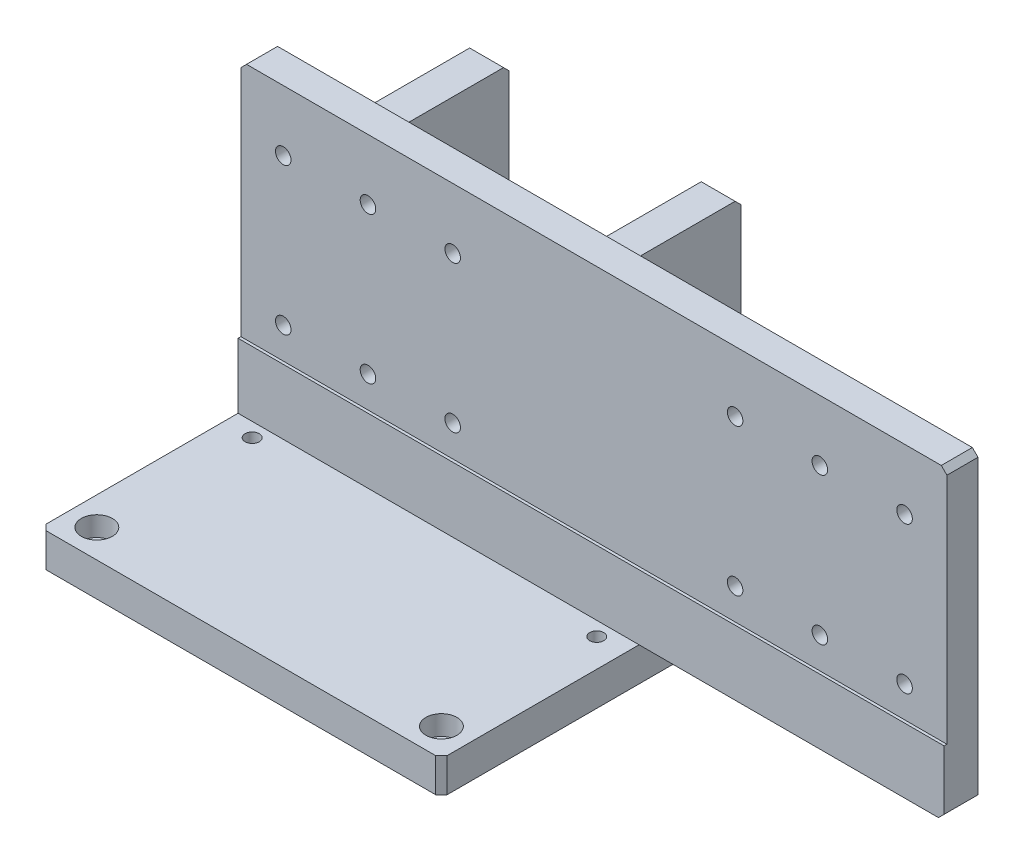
ISO-10303-21;
HEADER;
FILE_DESCRIPTION(('STEP AP214'),'2;1');
FILE_NAME('part.step','',(''),(''),'','','');
FILE_SCHEMA(('AUTOMOTIVE_DESIGN { 1 0 10303 214 1 1 1 1 }'));
ENDSEC;
DATA;
#1=APPLICATION_CONTEXT('core data for automotive mechanical design processes');
#2=APPLICATION_PROTOCOL_DEFINITION('international standard','automotive_design',2000,#1);
#3=PRODUCT_CONTEXT('',#1,'mechanical');
#4=PRODUCT('Part','Part','',(#3));
#5=PRODUCT_RELATED_PRODUCT_CATEGORY('part','',(#4));
#6=PRODUCT_DEFINITION_FORMATION('','',#4);
#7=PRODUCT_DEFINITION_CONTEXT('part definition',#1,'design');
#8=PRODUCT_DEFINITION('design','',#6,#7);
#9=PRODUCT_DEFINITION_SHAPE('','',#8);
#10=(LENGTH_UNIT() NAMED_UNIT(*) SI_UNIT(.MILLI.,.METRE.));
#11=(NAMED_UNIT(*) PLANE_ANGLE_UNIT() SI_UNIT($,.RADIAN.));
#12=(NAMED_UNIT(*) SI_UNIT($,.STERADIAN.) SOLID_ANGLE_UNIT());
#13=UNCERTAINTY_MEASURE_WITH_UNIT(LENGTH_MEASURE(1.E-05),#10,'distance_accuracy_value','');
#14=(GEOMETRIC_REPRESENTATION_CONTEXT(3) GLOBAL_UNCERTAINTY_ASSIGNED_CONTEXT((#13)) GLOBAL_UNIT_ASSIGNED_CONTEXT((#10,
#11,#12)) REPRESENTATION_CONTEXT('',''));
#15=CARTESIAN_POINT('',(0.,0.,0.));
#16=DIRECTION('',(0.,0.,1.));
#17=DIRECTION('',(1.,0.,0.));
#18=AXIS2_PLACEMENT_3D('',#15,#16,#17);
#19=CARTESIAN_POINT('',(35.,107.,-65.));
#20=DIRECTION('',(1.,0.,0.));
#21=DIRECTION('',(0.,0.,-1.));
#22=AXIS2_PLACEMENT_3D('',#19,#20,#21);
#23=PLANE('',#22);
#24=DIRECTION('',(0.,0.,1.));
#25=VECTOR('',#24,1.);
#26=CARTESIAN_POINT('',(35.,107.,-65.));
#27=LINE('',#26,#25);
#28=CARTESIAN_POINT('',(35.,107.,-63.));
#29=VERTEX_POINT('',#28);
#30=CARTESIAN_POINT('',(35.,107.,-17.));
#31=VERTEX_POINT('',#30);
#32=EDGE_CURVE('E107',#29,#31,#27,.T.);
#33=ORIENTED_EDGE('',*,*,#32,.F.);
#34=DIRECTION('',(0.,-0.707106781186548,-0.707106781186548));
#35=VECTOR('',#34,1.);
#36=CARTESIAN_POINT('',(35.,106.,-64.));
#37=LINE('',#36,#35);
#38=CARTESIAN_POINT('',(35.,105.,-65.));
#39=VERTEX_POINT('',#38);
#40=EDGE_CURVE('E61',#29,#39,#37,.T.);
#41=ORIENTED_EDGE('',*,*,#40,.T.);
#42=DIRECTION('',(0.,-1.,0.));
#43=VECTOR('',#42,1.);
#44=CARTESIAN_POINT('',(35.,107.,-65.));
#45=LINE('',#44,#43);
#46=CARTESIAN_POINT('',(35.,12.,-65.));
#47=VERTEX_POINT('',#46);
#48=EDGE_CURVE('E89',#39,#47,#45,.T.);
#49=ORIENTED_EDGE('',*,*,#48,.T.);
#50=DIRECTION('',(0.,0.,1.));
#51=VECTOR('',#50,1.);
#52=CARTESIAN_POINT('',(35.,12.,-65.));
#53=LINE('',#52,#51);
#54=CARTESIAN_POINT('',(35.,12.,-17.));
#55=VERTEX_POINT('',#54);
#56=EDGE_CURVE('E94',#47,#55,#53,.T.);
#57=ORIENTED_EDGE('',*,*,#56,.T.);
#58=DIRECTION('',(0.,-1.,0.));
#59=VECTOR('',#58,1.);
#60=CARTESIAN_POINT('',(35.,107.,-17.));
#61=LINE('',#60,#59);
#62=EDGE_CURVE('E55',#31,#55,#61,.T.);
#63=ORIENTED_EDGE('',*,*,#62,.F.);
#64=EDGE_LOOP('',(#33,#41,#49,#57,#63));
#65=FACE_BOUND('',#64,.T.);
#66=ADVANCED_FACE('F48',(#65),#23,.F.);
#67=CARTESIAN_POINT('',(35.,107.,-17.));
#68=DIRECTION('',(0.,0.,-1.));
#69=DIRECTION('',(-1.,0.,0.));
#70=AXIS2_PLACEMENT_3D('',#67,#68,#69);
#71=PLANE('',#70);
#72=DIRECTION('',(1.,0.,0.));
#73=VECTOR('',#72,1.);
#74=CARTESIAN_POINT('',(35.,12.,-17.));
#75=LINE('',#74,#73);
#76=CARTESIAN_POINT('',(47.,12.,-17.));
#77=VERTEX_POINT('',#76);
#78=EDGE_CURVE('E111',#55,#77,#75,.T.);
#79=ORIENTED_EDGE('',*,*,#78,.T.);
#80=DIRECTION('',(0.,-1.,0.));
#81=VECTOR('',#80,1.);
#82=CARTESIAN_POINT('',(47.,107.,-17.));
#83=LINE('',#82,#81);
#84=CARTESIAN_POINT('',(47.,107.,-17.));
#85=VERTEX_POINT('',#84);
#86=EDGE_CURVE('E122',#85,#77,#83,.T.);
#87=ORIENTED_EDGE('',*,*,#86,.F.);
#88=DIRECTION('',(1.,0.,0.));
#89=VECTOR('',#88,1.);
#90=CARTESIAN_POINT('',(35.,107.,-17.));
#91=LINE('',#90,#89);
#92=EDGE_CURVE('E70',#31,#85,#91,.T.);
#93=ORIENTED_EDGE('',*,*,#92,.F.);
#94=ORIENTED_EDGE('',*,*,#62,.T.);
#95=EDGE_LOOP('',(#79,#87,#93,#94));
#96=FACE_BOUND('',#95,.T.);
#97=ADVANCED_FACE('F125',(#96),#71,.F.);
#98=CARTESIAN_POINT('',(47.,107.,-65.));
#99=DIRECTION('',(-1.,0.,0.));
#100=DIRECTION('',(0.,0.,1.));
#101=AXIS2_PLACEMENT_3D('',#98,#99,#100);
#102=PLANE('',#101);
#103=DIRECTION('',(0.,-1.,0.));
#104=VECTOR('',#103,1.);
#105=CARTESIAN_POINT('',(47.,107.,-65.));
#106=LINE('',#105,#104);
#107=CARTESIAN_POINT('',(47.,105.,-65.));
#108=VERTEX_POINT('',#107);
#109=CARTESIAN_POINT('',(47.,12.,-65.));
#110=VERTEX_POINT('',#109);
#111=EDGE_CURVE('E97',#108,#110,#106,.T.);
#112=ORIENTED_EDGE('',*,*,#111,.F.);
#113=DIRECTION('',(0.,-0.707106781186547,-0.707106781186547));
#114=VECTOR('',#113,1.);
#115=CARTESIAN_POINT('',(47.,105.,-65.));
#116=LINE('',#115,#114);
#117=CARTESIAN_POINT('',(47.,107.,-63.));
#118=VERTEX_POINT('',#117);
#119=EDGE_CURVE('E129',#118,#108,#116,.T.);
#120=ORIENTED_EDGE('',*,*,#119,.F.);
#121=DIRECTION('',(0.,0.,-1.));
#122=VECTOR('',#121,1.);
#123=CARTESIAN_POINT('',(47.,107.,-65.));
#124=LINE('',#123,#122);
#125=EDGE_CURVE('E98',#85,#118,#124,.T.);
#126=ORIENTED_EDGE('',*,*,#125,.F.);
#127=ORIENTED_EDGE('',*,*,#86,.T.);
#128=DIRECTION('',(0.,0.,-1.));
#129=VECTOR('',#128,1.);
#130=CARTESIAN_POINT('',(47.,12.,-65.));
#131=LINE('',#130,#129);
#132=EDGE_CURVE('E108',#77,#110,#131,.T.);
#133=ORIENTED_EDGE('',*,*,#132,.T.);
#134=EDGE_LOOP('',(#112,#120,#126,#127,#133));
#135=FACE_BOUND('',#134,.T.);
#136=ADVANCED_FACE('F138',(#135),#102,.F.);
#137=CARTESIAN_POINT('',(35.,107.,-65.));
#138=DIRECTION('',(0.,0.,1.));
#139=DIRECTION('',(1.,0.,0.));
#140=AXIS2_PLACEMENT_3D('',#137,#138,#139);
#141=PLANE('',#140);
#142=ORIENTED_EDGE('',*,*,#48,.F.);
#143=DIRECTION('',(1.,0.,0.));
#144=VECTOR('',#143,1.);
#145=CARTESIAN_POINT('',(-71.,105.,-65.));
#146=LINE('',#145,#144);
#147=EDGE_CURVE('E115',#39,#108,#146,.T.);
#148=ORIENTED_EDGE('',*,*,#147,.T.);
#149=ORIENTED_EDGE('',*,*,#111,.T.);
#150=DIRECTION('',(-1.,0.,0.));
#151=VECTOR('',#150,1.);
#152=CARTESIAN_POINT('',(35.,12.,-65.));
#153=LINE('',#152,#151);
#154=EDGE_CURVE('E101',#110,#47,#153,.T.);
#155=ORIENTED_EDGE('',*,*,#154,.T.);
#156=EDGE_LOOP('',(#142,#148,#149,#155));
#157=FACE_BOUND('',#156,.T.);
#158=ADVANCED_FACE('F102',(#157),#141,.F.);
#159=CARTESIAN_POINT('',(0.,107.,0.));
#160=DIRECTION('',(0.,1.,0.));
#161=DIRECTION('',(0.,0.,1.));
#162=AXIS2_PLACEMENT_3D('',#159,#160,#161);
#163=PLANE('',#162);
#164=DIRECTION('',(1.,0.,0.));
#165=VECTOR('',#164,1.);
#166=CARTESIAN_POINT('',(0.,107.,-63.));
#167=LINE('',#166,#165);
#168=EDGE_CURVE('E12',#29,#118,#167,.T.);
#169=ORIENTED_EDGE('',*,*,#168,.F.);
#170=ORIENTED_EDGE('',*,*,#32,.T.);
#171=ORIENTED_EDGE('',*,*,#92,.T.);
#172=ORIENTED_EDGE('',*,*,#125,.T.);
#173=EDGE_LOOP('',(#169,#170,#171,#172));
#174=FACE_BOUND('',#173,.T.);
#175=ADVANCED_FACE('F139',(#174),#163,.T.);
#176=CARTESIAN_POINT('',(0.,12.,0.));
#177=DIRECTION('',(0.,1.,0.));
#178=DIRECTION('',(0.,0.,1.));
#179=AXIS2_PLACEMENT_3D('',#176,#177,#178);
#180=PLANE('',#179);
#181=ORIENTED_EDGE('',*,*,#56,.F.);
#182=ORIENTED_EDGE('',*,*,#154,.F.);
#183=ORIENTED_EDGE('',*,*,#132,.F.);
#184=ORIENTED_EDGE('',*,*,#78,.F.);
#185=EDGE_LOOP('',(#181,#182,#183,#184));
#186=FACE_BOUND('',#185,.T.);
#187=ADVANCED_FACE('F110',(#186),#180,.F.);
#188=CARTESIAN_POINT('',(-71.,105.,-65.));
#189=DIRECTION('',(0.,-0.707106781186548,0.707106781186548));
#190=DIRECTION('',(0.,-0.707106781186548,-0.707106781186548));
#191=AXIS2_PLACEMENT_3D('',#188,#189,#190);
#192=PLANE('',#191);
#193=ORIENTED_EDGE('',*,*,#168,.T.);
#194=ORIENTED_EDGE('',*,*,#119,.T.);
#195=ORIENTED_EDGE('',*,*,#147,.F.);
#196=ORIENTED_EDGE('',*,*,#40,.F.);
#197=EDGE_LOOP('',(#193,#194,#195,#196));
#198=FACE_BOUND('',#197,.T.);
#199=ADVANCED_FACE('F133',(#198),#192,.F.);
#200=CLOSED_SHELL('',(#66,#97,#136,#158,#175,#187,#199));
#201=MANIFOLD_SOLID_BREP('B2',#200);
#202=CARTESIAN_POINT('',(-47.,107.,-65.));
#203=DIRECTION('',(1.,0.,0.));
#204=DIRECTION('',(0.,0.,-1.));
#205=AXIS2_PLACEMENT_3D('',#202,#203,#204);
#206=PLANE('',#205);
#207=DIRECTION('',(0.,0.,1.));
#208=VECTOR('',#207,1.);
#209=CARTESIAN_POINT('',(-47.,107.,-65.));
#210=LINE('',#209,#208);
#211=CARTESIAN_POINT('',(-47.,107.,-63.));
#212=VERTEX_POINT('',#211);
#213=CARTESIAN_POINT('',(-47.,107.,-17.));
#214=VERTEX_POINT('',#213);
#215=EDGE_CURVE('E268',#212,#214,#210,.T.);
#216=ORIENTED_EDGE('',*,*,#215,.F.);
#217=DIRECTION('',(0.,-0.707106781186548,-0.707106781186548));
#218=VECTOR('',#217,1.);
#219=CARTESIAN_POINT('',(-47.,106.,-64.));
#220=LINE('',#219,#218);
#221=CARTESIAN_POINT('',(-47.,105.,-65.));
#222=VERTEX_POINT('',#221);
#223=EDGE_CURVE('E221',#212,#222,#220,.T.);
#224=ORIENTED_EDGE('',*,*,#223,.T.);
#225=DIRECTION('',(0.,-1.,0.));
#226=VECTOR('',#225,1.);
#227=CARTESIAN_POINT('',(-47.,107.,-65.));
#228=LINE('',#227,#226);
#229=CARTESIAN_POINT('',(-47.,12.,-65.));
#230=VERTEX_POINT('',#229);
#231=EDGE_CURVE('E249',#222,#230,#228,.T.);
#232=ORIENTED_EDGE('',*,*,#231,.T.);
#233=DIRECTION('',(0.,0.,1.));
#234=VECTOR('',#233,1.);
#235=CARTESIAN_POINT('',(-47.,12.,-65.));
#236=LINE('',#235,#234);
#237=CARTESIAN_POINT('',(-47.,12.,-17.));
#238=VERTEX_POINT('',#237);
#239=EDGE_CURVE('E254',#230,#238,#236,.T.);
#240=ORIENTED_EDGE('',*,*,#239,.T.);
#241=DIRECTION('',(0.,-1.,0.));
#242=VECTOR('',#241,1.);
#243=CARTESIAN_POINT('',(-47.,107.,-17.));
#244=LINE('',#243,#242);
#245=EDGE_CURVE('E215',#214,#238,#244,.T.);
#246=ORIENTED_EDGE('',*,*,#245,.F.);
#247=EDGE_LOOP('',(#216,#224,#232,#240,#246));
#248=FACE_BOUND('',#247,.T.);
#249=ADVANCED_FACE('F208',(#248),#206,.F.);
#250=CARTESIAN_POINT('',(-47.,107.,-17.));
#251=DIRECTION('',(0.,0.,-1.));
#252=DIRECTION('',(-1.,0.,0.));
#253=AXIS2_PLACEMENT_3D('',#250,#251,#252);
#254=PLANE('',#253);
#255=DIRECTION('',(1.,0.,0.));
#256=VECTOR('',#255,1.);
#257=CARTESIAN_POINT('',(-47.,12.,-17.));
#258=LINE('',#257,#256);
#259=CARTESIAN_POINT('',(-35.,12.,-17.));
#260=VERTEX_POINT('',#259);
#261=EDGE_CURVE('E272',#238,#260,#258,.T.);
#262=ORIENTED_EDGE('',*,*,#261,.T.);
#263=DIRECTION('',(0.,-1.,0.));
#264=VECTOR('',#263,1.);
#265=CARTESIAN_POINT('',(-35.,107.,-17.));
#266=LINE('',#265,#264);
#267=CARTESIAN_POINT('',(-35.,107.,-17.));
#268=VERTEX_POINT('',#267);
#269=EDGE_CURVE('E283',#268,#260,#266,.T.);
#270=ORIENTED_EDGE('',*,*,#269,.F.);
#271=DIRECTION('',(1.,0.,0.));
#272=VECTOR('',#271,1.);
#273=CARTESIAN_POINT('',(-47.,107.,-17.));
#274=LINE('',#273,#272);
#275=EDGE_CURVE('E230',#214,#268,#274,.T.);
#276=ORIENTED_EDGE('',*,*,#275,.F.);
#277=ORIENTED_EDGE('',*,*,#245,.T.);
#278=EDGE_LOOP('',(#262,#270,#276,#277));
#279=FACE_BOUND('',#278,.T.);
#280=ADVANCED_FACE('F286',(#279),#254,.F.);
#281=CARTESIAN_POINT('',(-35.,107.,-65.));
#282=DIRECTION('',(-1.,0.,0.));
#283=DIRECTION('',(0.,0.,1.));
#284=AXIS2_PLACEMENT_3D('',#281,#282,#283);
#285=PLANE('',#284);
#286=DIRECTION('',(0.,-1.,0.));
#287=VECTOR('',#286,1.);
#288=CARTESIAN_POINT('',(-35.,107.,-65.));
#289=LINE('',#288,#287);
#290=CARTESIAN_POINT('',(-35.,105.,-65.));
#291=VERTEX_POINT('',#290);
#292=CARTESIAN_POINT('',(-35.,12.,-65.));
#293=VERTEX_POINT('',#292);
#294=EDGE_CURVE('E258',#291,#293,#289,.T.);
#295=ORIENTED_EDGE('',*,*,#294,.F.);
#296=DIRECTION('',(0.,0.707106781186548,0.707106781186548));
#297=VECTOR('',#296,1.);
#298=CARTESIAN_POINT('',(-35.,106.,-64.));
#299=LINE('',#298,#297);
#300=CARTESIAN_POINT('',(-35.,107.,-63.));
#301=VERTEX_POINT('',#300);
#302=EDGE_CURVE('E276',#291,#301,#299,.T.);
#303=ORIENTED_EDGE('',*,*,#302,.T.);
#304=DIRECTION('',(0.,0.,-1.));
#305=VECTOR('',#304,1.);
#306=CARTESIAN_POINT('',(-35.,107.,-65.));
#307=LINE('',#306,#305);
#308=EDGE_CURVE('E259',#268,#301,#307,.T.);
#309=ORIENTED_EDGE('',*,*,#308,.F.);
#310=ORIENTED_EDGE('',*,*,#269,.T.);
#311=DIRECTION('',(0.,0.,-1.));
#312=VECTOR('',#311,1.);
#313=CARTESIAN_POINT('',(-35.,12.,-65.));
#314=LINE('',#313,#312);
#315=EDGE_CURVE('E269',#260,#293,#314,.T.);
#316=ORIENTED_EDGE('',*,*,#315,.T.);
#317=EDGE_LOOP('',(#295,#303,#309,#310,#316));
#318=FACE_BOUND('',#317,.T.);
#319=ADVANCED_FACE('F294',(#318),#285,.F.);
#320=CARTESIAN_POINT('',(-47.,107.,-65.));
#321=DIRECTION('',(0.,0.,1.));
#322=DIRECTION('',(1.,0.,0.));
#323=AXIS2_PLACEMENT_3D('',#320,#321,#322);
#324=PLANE('',#323);
#325=ORIENTED_EDGE('',*,*,#231,.F.);
#326=DIRECTION('',(1.,0.,0.));
#327=VECTOR('',#326,1.);
#328=CARTESIAN_POINT('',(-71.,105.,-65.));
#329=LINE('',#328,#327);
#330=EDGE_CURVE('E291',#222,#291,#329,.T.);
#331=ORIENTED_EDGE('',*,*,#330,.T.);
#332=ORIENTED_EDGE('',*,*,#294,.T.);
#333=DIRECTION('',(-1.,0.,0.));
#334=VECTOR('',#333,1.);
#335=CARTESIAN_POINT('',(-47.,12.,-65.));
#336=LINE('',#335,#334);
#337=EDGE_CURVE('E262',#293,#230,#336,.T.);
#338=ORIENTED_EDGE('',*,*,#337,.T.);
#339=EDGE_LOOP('',(#325,#331,#332,#338));
#340=FACE_BOUND('',#339,.T.);
#341=ADVANCED_FACE('F263',(#340),#324,.F.);
#342=CARTESIAN_POINT('',(0.,107.,0.));
#343=DIRECTION('',(0.,1.,0.));
#344=DIRECTION('',(0.,0.,1.));
#345=AXIS2_PLACEMENT_3D('',#342,#343,#344);
#346=PLANE('',#345);
#347=DIRECTION('',(1.,0.,0.));
#348=VECTOR('',#347,1.);
#349=CARTESIAN_POINT('',(0.,107.,-63.));
#350=LINE('',#349,#348);
#351=EDGE_CURVE('E46',#212,#301,#350,.T.);
#352=ORIENTED_EDGE('',*,*,#351,.F.);
#353=ORIENTED_EDGE('',*,*,#215,.T.);
#354=ORIENTED_EDGE('',*,*,#275,.T.);
#355=ORIENTED_EDGE('',*,*,#308,.T.);
#356=EDGE_LOOP('',(#352,#353,#354,#355));
#357=FACE_BOUND('',#356,.T.);
#358=ADVANCED_FACE('F297',(#357),#346,.T.);
#359=CARTESIAN_POINT('',(0.,12.,0.));
#360=DIRECTION('',(0.,1.,0.));
#361=DIRECTION('',(0.,0.,1.));
#362=AXIS2_PLACEMENT_3D('',#359,#360,#361);
#363=PLANE('',#362);
#364=ORIENTED_EDGE('',*,*,#239,.F.);
#365=ORIENTED_EDGE('',*,*,#337,.F.);
#366=ORIENTED_EDGE('',*,*,#315,.F.);
#367=ORIENTED_EDGE('',*,*,#261,.F.);
#368=EDGE_LOOP('',(#364,#365,#366,#367));
#369=FACE_BOUND('',#368,.T.);
#370=ADVANCED_FACE('F271',(#369),#363,.F.);
#371=CARTESIAN_POINT('',(-71.,105.,-65.));
#372=DIRECTION('',(0.,-0.707106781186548,0.707106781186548));
#373=DIRECTION('',(0.,-0.707106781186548,-0.707106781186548));
#374=AXIS2_PLACEMENT_3D('',#371,#372,#373);
#375=PLANE('',#374);
#376=ORIENTED_EDGE('',*,*,#351,.T.);
#377=ORIENTED_EDGE('',*,*,#302,.F.);
#378=ORIENTED_EDGE('',*,*,#330,.F.);
#379=ORIENTED_EDGE('',*,*,#223,.F.);
#380=EDGE_LOOP('',(#376,#377,#378,#379));
#381=FACE_BOUND('',#380,.T.);
#382=ADVANCED_FACE('F300',(#381),#375,.F.);
#383=CLOSED_SHELL('',(#249,#280,#319,#341,#358,#370,#382));
#384=MANIFOLD_SOLID_BREP('B6',#383);
#385=CARTESIAN_POINT('',(0.,119.5,0.));
#386=DIRECTION('',(0.,1.,0.));
#387=DIRECTION('',(0.,0.,1.));
#388=AXIS2_PLACEMENT_3D('',#385,#386,#387);
#389=PLANE('',#388);
#390=DIRECTION('',(-1.,0.,0.));
#391=VECTOR('',#390,1.);
#392=CARTESIAN_POINT('',(-71.,119.5,-6.));
#393=LINE('',#392,#391);
#394=CARTESIAN_POINT('',(177.,119.5,-6.));
#395=VERTEX_POINT('',#394);
#396=CARTESIAN_POINT('',(-69.,119.5,-6.));
#397=VERTEX_POINT('',#396);
#398=EDGE_CURVE('E457',#395,#397,#393,.T.);
#399=ORIENTED_EDGE('',*,*,#398,.F.);
#400=DIRECTION('',(0.,0.,-1.));
#401=VECTOR('',#400,1.);
#402=CARTESIAN_POINT('',(177.,119.5,-17.));
#403=LINE('',#402,#401);
#404=CARTESIAN_POINT('',(177.,119.5,-17.));
#405=VERTEX_POINT('',#404);
#406=EDGE_CURVE('E529',#395,#405,#403,.T.);
#407=ORIENTED_EDGE('',*,*,#406,.T.);
#408=DIRECTION('',(-1.,0.,0.));
#409=VECTOR('',#408,1.);
#410=CARTESIAN_POINT('',(-71.,119.5,-17.));
#411=LINE('',#410,#409);
#412=CARTESIAN_POINT('',(-69.,119.5,-17.));
#413=VERTEX_POINT('',#412);
#414=EDGE_CURVE('E464',#405,#413,#411,.T.);
#415=ORIENTED_EDGE('',*,*,#414,.T.);
#416=DIRECTION('',(0.,0.,1.));
#417=VECTOR('',#416,1.);
#418=CARTESIAN_POINT('',(-69.,119.5,-6.));
#419=LINE('',#418,#417);
#420=EDGE_CURVE('E527',#413,#397,#419,.T.);
#421=ORIENTED_EDGE('',*,*,#420,.T.);
#422=EDGE_LOOP('',(#399,#407,#415,#421));
#423=FACE_BOUND('',#422,.T.);
#424=ADVANCED_FACE('F367',(#423),#389,.T.);
#425=CARTESIAN_POINT('',(-71.,119.5,-17.));
#426=DIRECTION('',(1.,0.,0.));
#427=DIRECTION('',(0.,0.,-1.));
#428=AXIS2_PLACEMENT_3D('',#425,#426,#427);
#429=PLANE('',#428);
#430=DIRECTION('',(0.,-1.,0.));
#431=VECTOR('',#430,1.);
#432=CARTESIAN_POINT('',(-71.,119.5,-6.));
#433=LINE('',#432,#431);
#434=CARTESIAN_POINT('',(-71.,117.5,-6.));
#435=VERTEX_POINT('',#434);
#436=CARTESIAN_POINT('',(-71.,35.,-6.));
#437=VERTEX_POINT('',#436);
#438=EDGE_CURVE('E435',#435,#437,#433,.T.);
#439=ORIENTED_EDGE('',*,*,#438,.F.);
#440=DIRECTION('',(0.,0.,-1.));
#441=VECTOR('',#440,1.);
#442=CARTESIAN_POINT('',(-71.,117.5,-17.));
#443=LINE('',#442,#441);
#444=CARTESIAN_POINT('',(-71.,117.5,-17.));
#445=VERTEX_POINT('',#444);
#446=EDGE_CURVE('E206',#435,#445,#443,.T.);
#447=ORIENTED_EDGE('',*,*,#446,.T.);
#448=DIRECTION('',(0.,-1.,0.));
#449=VECTOR('',#448,1.);
#450=CARTESIAN_POINT('',(-71.,119.5,-17.));
#451=LINE('',#450,#449);
#452=CARTESIAN_POINT('',(-71.,12.,-17.));
#453=VERTEX_POINT('',#452);
#454=EDGE_CURVE('E467',#445,#453,#451,.T.);
#455=ORIENTED_EDGE('',*,*,#454,.T.);
#456=DIRECTION('',(0.,0.,1.));
#457=VECTOR('',#456,1.);
#458=CARTESIAN_POINT('',(-71.,12.,-17.));
#459=LINE('',#458,#457);
#460=CARTESIAN_POINT('',(-71.,12.,-5.));
#461=VERTEX_POINT('',#460);
#462=EDGE_CURVE('E459',#453,#461,#459,.T.);
#463=ORIENTED_EDGE('',*,*,#462,.T.);
#464=DIRECTION('',(0.,-1.,0.));
#465=VECTOR('',#464,1.);
#466=CARTESIAN_POINT('',(-71.,119.5,-5.));
#467=LINE('',#466,#465);
#468=CARTESIAN_POINT('',(-71.,35.,-5.));
#469=VERTEX_POINT('',#468);
#470=EDGE_CURVE('E456',#469,#461,#467,.T.);
#471=ORIENTED_EDGE('',*,*,#470,.F.);
#472=DIRECTION('',(0.,0.,1.));
#473=VECTOR('',#472,1.);
#474=CARTESIAN_POINT('',(-71.,35.,-6.));
#475=LINE('',#474,#473);
#476=EDGE_CURVE('E447',#437,#469,#475,.T.);
#477=ORIENTED_EDGE('',*,*,#476,.F.);
#478=EDGE_LOOP('',(#439,#447,#455,#463,#471,#477));
#479=FACE_BOUND('',#478,.T.);
#480=ADVANCED_FACE('F454',(#479),#429,.F.);
#481=CARTESIAN_POINT('',(-71.,119.5,-5.));
#482=DIRECTION('',(0.,0.,-1.));
#483=DIRECTION('',(-1.,0.,0.));
#484=AXIS2_PLACEMENT_3D('',#481,#482,#483);
#485=PLANE('',#484);
#486=DIRECTION('',(1.,0.,0.));
#487=VECTOR('',#486,1.);
#488=CARTESIAN_POINT('',(-71.,12.,-5.));
#489=LINE('',#488,#487);
#490=CARTESIAN_POINT('',(177.,12.,-5.));
#491=VERTEX_POINT('',#490);
#492=EDGE_CURVE('E470',#461,#491,#489,.T.);
#493=ORIENTED_EDGE('',*,*,#492,.T.);
#494=DIRECTION('',(-0.707106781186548,-0.707106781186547,0.));
#495=VECTOR('',#494,1.);
#496=CARTESIAN_POINT('',(179.,14.,-5.));
#497=LINE('',#496,#495);
#498=CARTESIAN_POINT('',(179.,14.,-5.));
#499=VERTEX_POINT('',#498);
#500=EDGE_CURVE('E525',#491,#499,#497,.F.);
#501=ORIENTED_EDGE('',*,*,#500,.T.);
#502=DIRECTION('',(0.,-1.,0.));
#503=VECTOR('',#502,1.);
#504=CARTESIAN_POINT('',(179.,119.5,-5.));
#505=LINE('',#504,#503);
#506=CARTESIAN_POINT('',(179.,35.,-5.));
#507=VERTEX_POINT('',#506);
#508=EDGE_CURVE('E479',#507,#499,#505,.T.);
#509=ORIENTED_EDGE('',*,*,#508,.F.);
#510=DIRECTION('',(1.,0.,0.));
#511=VECTOR('',#510,1.);
#512=CARTESIAN_POINT('',(-71.,35.,-5.));
#513=LINE('',#512,#511);
#514=EDGE_CURVE('E443',#469,#507,#513,.T.);
#515=ORIENTED_EDGE('',*,*,#514,.F.);
#516=ORIENTED_EDGE('',*,*,#470,.T.);
#517=EDGE_LOOP('',(#493,#501,#509,#515,#516));
#518=FACE_BOUND('',#517,.T.);
#519=ADVANCED_FACE('F567',(#518),#485,.F.);
#520=CARTESIAN_POINT('',(179.,119.5,-17.));
#521=DIRECTION('',(-1.,0.,0.));
#522=DIRECTION('',(0.,0.,1.));
#523=AXIS2_PLACEMENT_3D('',#520,#521,#522);
#524=PLANE('',#523);
#525=ORIENTED_EDGE('',*,*,#508,.T.);
#526=DIRECTION('',(0.,0.,-1.));
#527=VECTOR('',#526,1.);
#528=CARTESIAN_POINT('',(179.,14.,-17.));
#529=LINE('',#528,#527);
#530=CARTESIAN_POINT('',(179.,14.,-17.));
#531=VERTEX_POINT('',#530);
#532=EDGE_CURVE('E514',#499,#531,#529,.T.);
#533=ORIENTED_EDGE('',*,*,#532,.T.);
#534=DIRECTION('',(0.,-1.,0.));
#535=VECTOR('',#534,1.);
#536=CARTESIAN_POINT('',(179.,119.5,-17.));
#537=LINE('',#536,#535);
#538=CARTESIAN_POINT('',(179.,117.5,-17.));
#539=VERTEX_POINT('',#538);
#540=EDGE_CURVE('E476',#539,#531,#537,.T.);
#541=ORIENTED_EDGE('',*,*,#540,.F.);
#542=DIRECTION('',(0.,0.,1.));
#543=VECTOR('',#542,1.);
#544=CARTESIAN_POINT('',(179.,117.5,-6.));
#545=LINE('',#544,#543);
#546=CARTESIAN_POINT('',(179.,117.5,-6.));
#547=VERTEX_POINT('',#546);
#548=EDGE_CURVE('E483',#539,#547,#545,.T.);
#549=ORIENTED_EDGE('',*,*,#548,.T.);
#550=DIRECTION('',(0.,1.,0.));
#551=VECTOR('',#550,1.);
#552=CARTESIAN_POINT('',(179.,119.5,-6.));
#553=LINE('',#552,#551);
#554=CARTESIAN_POINT('',(179.,35.,-6.));
#555=VERTEX_POINT('',#554);
#556=EDGE_CURVE('E451',#555,#547,#553,.T.);
#557=ORIENTED_EDGE('',*,*,#556,.F.);
#558=DIRECTION('',(0.,0.,1.));
#559=VECTOR('',#558,1.);
#560=CARTESIAN_POINT('',(179.,35.,-6.));
#561=LINE('',#560,#559);
#562=EDGE_CURVE('E450',#555,#507,#561,.T.);
#563=ORIENTED_EDGE('',*,*,#562,.T.);
#564=EDGE_LOOP('',(#525,#533,#541,#549,#557,#563));
#565=FACE_BOUND('',#564,.T.);
#566=ADVANCED_FACE('F544',(#565),#524,.F.);
#567=CARTESIAN_POINT('',(-71.,119.5,-17.));
#568=DIRECTION('',(0.,0.,1.));
#569=DIRECTION('',(1.,0.,0.));
#570=AXIS2_PLACEMENT_3D('',#567,#568,#569);
#571=PLANE('',#570);
#572=CARTESIAN_POINT('',(134.,98.,-17.));
#573=DIRECTION('',(0.,0.,-1.));
#574=DIRECTION('',(-1.,0.,0.));
#575=AXIS2_PLACEMENT_3D('',#572,#573,#574);
#576=CIRCLE('',#575,4.75);
#577=CARTESIAN_POINT('',(129.25,98.,-17.));
#578=VERTEX_POINT('',#577);
#579=EDGE_CURVE('E877',#578,#578,#576,.T.);
#580=ORIENTED_EDGE('',*,*,#579,.F.);
#581=EDGE_LOOP('',(#580));
#582=FACE_BOUND('',#581,.T.);
#583=CARTESIAN_POINT('',(104.,98.,-17.));
#584=DIRECTION('',(0.,0.,-1.));
#585=DIRECTION('',(-1.,0.,0.));
#586=AXIS2_PLACEMENT_3D('',#583,#584,#585);
#587=CIRCLE('',#586,4.75);
#588=CARTESIAN_POINT('',(99.25,98.,-17.));
#589=VERTEX_POINT('',#588);
#590=EDGE_CURVE('E867',#589,#589,#587,.T.);
#591=ORIENTED_EDGE('',*,*,#590,.F.);
#592=EDGE_LOOP('',(#591));
#593=FACE_BOUND('',#592,.T.);
#594=CARTESIAN_POINT('',(164.,46.,-17.));
#595=DIRECTION('',(0.,0.,-1.));
#596=DIRECTION('',(-1.,0.,0.));
#597=AXIS2_PLACEMENT_3D('',#594,#595,#596);
#598=CIRCLE('',#597,4.75);
#599=CARTESIAN_POINT('',(159.25,46.,-17.));
#600=VERTEX_POINT('',#599);
#601=EDGE_CURVE('E857',#600,#600,#598,.T.);
#602=ORIENTED_EDGE('',*,*,#601,.F.);
#603=EDGE_LOOP('',(#602));
#604=FACE_BOUND('',#603,.T.);
#605=CARTESIAN_POINT('',(134.,46.,-17.));
#606=DIRECTION('',(0.,0.,-1.));
#607=DIRECTION('',(-1.,0.,0.));
#608=AXIS2_PLACEMENT_3D('',#605,#606,#607);
#609=CIRCLE('',#608,4.75);
#610=CARTESIAN_POINT('',(129.25,46.,-17.));
#611=VERTEX_POINT('',#610);
#612=EDGE_CURVE('E847',#611,#611,#609,.T.);
#613=ORIENTED_EDGE('',*,*,#612,.F.);
#614=EDGE_LOOP('',(#613));
#615=FACE_BOUND('',#614,.T.);
#616=CARTESIAN_POINT('',(104.,46.,-17.));
#617=DIRECTION('',(0.,0.,-1.));
#618=DIRECTION('',(-1.,0.,0.));
#619=AXIS2_PLACEMENT_3D('',#616,#617,#618);
#620=CIRCLE('',#619,4.75);
#621=CARTESIAN_POINT('',(99.25,46.,-17.));
#622=VERTEX_POINT('',#621);
#623=EDGE_CURVE('E837',#622,#622,#620,.T.);
#624=ORIENTED_EDGE('',*,*,#623,.F.);
#625=EDGE_LOOP('',(#624));
#626=FACE_BOUND('',#625,.T.);
#627=CARTESIAN_POINT('',(164.,98.,-17.));
#628=DIRECTION('',(0.,0.,-1.));
#629=DIRECTION('',(-1.,0.,0.));
#630=AXIS2_PLACEMENT_3D('',#627,#628,#629);
#631=CIRCLE('',#630,4.75);
#632=CARTESIAN_POINT('',(159.25,98.,-17.));
#633=VERTEX_POINT('',#632);
#634=EDGE_CURVE('E827',#633,#633,#631,.T.);
#635=ORIENTED_EDGE('',*,*,#634,.F.);
#636=EDGE_LOOP('',(#635));
#637=FACE_BOUND('',#636,.T.);
#638=CARTESIAN_POINT('',(4.,98.,-17.));
#639=DIRECTION('',(0.,0.,-1.));
#640=DIRECTION('',(-1.,0.,0.));
#641=AXIS2_PLACEMENT_3D('',#638,#639,#640);
#642=CIRCLE('',#641,4.75);
#643=CARTESIAN_POINT('',(-0.749999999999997,98.,-17.));
#644=VERTEX_POINT('',#643);
#645=EDGE_CURVE('E817',#644,#644,#642,.T.);
#646=ORIENTED_EDGE('',*,*,#645,.F.);
#647=EDGE_LOOP('',(#646));
#648=FACE_BOUND('',#647,.T.);
#649=CARTESIAN_POINT('',(-26.,98.,-17.));
#650=DIRECTION('',(0.,0.,-1.));
#651=DIRECTION('',(-1.,0.,0.));
#652=AXIS2_PLACEMENT_3D('',#649,#650,#651);
#653=CIRCLE('',#652,4.75);
#654=CARTESIAN_POINT('',(-30.75,98.,-17.));
#655=VERTEX_POINT('',#654);
#656=EDGE_CURVE('E511',#655,#655,#653,.T.);
#657=ORIENTED_EDGE('',*,*,#656,.F.);
#658=EDGE_LOOP('',(#657));
#659=FACE_BOUND('',#658,.T.);
#660=CARTESIAN_POINT('',(-56.,98.,-17.));
#661=DIRECTION('',(0.,0.,-1.));
#662=DIRECTION('',(-1.,0.,0.));
#663=AXIS2_PLACEMENT_3D('',#660,#661,#662);
#664=CIRCLE('',#663,4.75);
#665=CARTESIAN_POINT('',(-60.75,98.,-17.));
#666=VERTEX_POINT('',#665);
#667=EDGE_CURVE('E506',#666,#666,#664,.T.);
#668=ORIENTED_EDGE('',*,*,#667,.F.);
#669=EDGE_LOOP('',(#668));
#670=FACE_BOUND('',#669,.T.);
#671=CARTESIAN_POINT('',(4.,46.,-17.));
#672=DIRECTION('',(0.,0.,-1.));
#673=DIRECTION('',(-1.,0.,0.));
#674=AXIS2_PLACEMENT_3D('',#671,#672,#673);
#675=CIRCLE('',#674,4.75);
#676=CARTESIAN_POINT('',(-0.749999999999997,46.,-17.));
#677=VERTEX_POINT('',#676);
#678=EDGE_CURVE('E501',#677,#677,#675,.T.);
#679=ORIENTED_EDGE('',*,*,#678,.F.);
#680=EDGE_LOOP('',(#679));
#681=FACE_BOUND('',#680,.T.);
#682=CARTESIAN_POINT('',(-26.,46.,-17.));
#683=DIRECTION('',(0.,0.,-1.));
#684=DIRECTION('',(-1.,0.,0.));
#685=AXIS2_PLACEMENT_3D('',#682,#683,#684);
#686=CIRCLE('',#685,4.75);
#687=CARTESIAN_POINT('',(-30.75,46.,-17.));
#688=VERTEX_POINT('',#687);
#689=EDGE_CURVE('E496',#688,#688,#686,.T.);
#690=ORIENTED_EDGE('',*,*,#689,.F.);
#691=EDGE_LOOP('',(#690));
#692=FACE_BOUND('',#691,.T.);
#693=CARTESIAN_POINT('',(-56.,46.,-17.));
#694=DIRECTION('',(0.,0.,-1.));
#695=DIRECTION('',(-1.,0.,0.));
#696=AXIS2_PLACEMENT_3D('',#693,#694,#695);
#697=CIRCLE('',#696,4.75);
#698=CARTESIAN_POINT('',(-60.75,46.,-17.));
#699=VERTEX_POINT('',#698);
#700=EDGE_CURVE('E491',#699,#699,#697,.T.);
#701=ORIENTED_EDGE('',*,*,#700,.F.);
#702=EDGE_LOOP('',(#701));
#703=FACE_BOUND('',#702,.T.);
#704=ORIENTED_EDGE('',*,*,#540,.T.);
#705=DIRECTION('',(0.707106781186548,0.707106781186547,0.));
#706=VECTOR('',#705,1.);
#707=CARTESIAN_POINT('',(179.,14.,-17.));
#708=LINE('',#707,#706);
#709=CARTESIAN_POINT('',(177.,12.,-17.));
#710=VERTEX_POINT('',#709);
#711=EDGE_CURVE('E521',#531,#710,#708,.F.);
#712=ORIENTED_EDGE('',*,*,#711,.T.);
#713=DIRECTION('',(-1.,0.,0.));
#714=VECTOR('',#713,1.);
#715=CARTESIAN_POINT('',(-71.,12.,-17.));
#716=LINE('',#715,#714);
#717=EDGE_CURVE('E468',#710,#453,#716,.T.);
#718=ORIENTED_EDGE('',*,*,#717,.T.);
#719=ORIENTED_EDGE('',*,*,#454,.F.);
#720=DIRECTION('',(0.707106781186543,0.707106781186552,0.));
#721=VECTOR('',#720,1.);
#722=CARTESIAN_POINT('',(-69.,119.5,-17.));
#723=LINE('',#722,#721);
#724=EDGE_CURVE('E517',#445,#413,#723,.T.);
#725=ORIENTED_EDGE('',*,*,#724,.T.);
#726=ORIENTED_EDGE('',*,*,#414,.F.);
#727=DIRECTION('',(0.707106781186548,-0.707106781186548,0.));
#728=VECTOR('',#727,1.);
#729=CARTESIAN_POINT('',(177.,119.5,-17.));
#730=LINE('',#729,#728);
#731=EDGE_CURVE('E519',#405,#539,#730,.T.);
#732=ORIENTED_EDGE('',*,*,#731,.T.);
#733=EDGE_LOOP('',(#704,#712,#718,#719,#725,#726,#732));
#734=FACE_BOUND('',#733,.T.);
#735=ADVANCED_FACE('F542',(#582,#593,#604,#615,#626,#637,#648,#659,#670,#681,#692,#703,#734),
#571,.F.);
#736=CARTESIAN_POINT('',(0.,12.,0.));
#737=DIRECTION('',(0.,1.,0.));
#738=DIRECTION('',(0.,0.,1.));
#739=AXIS2_PLACEMENT_3D('',#736,#737,#738);
#740=PLANE('',#739);
#741=ORIENTED_EDGE('',*,*,#717,.F.);
#742=DIRECTION('',(0.,0.,1.));
#743=VECTOR('',#742,1.);
#744=CARTESIAN_POINT('',(177.,12.,0.));
#745=LINE('',#744,#743);
#746=EDGE_CURVE('E523',#710,#491,#745,.T.);
#747=ORIENTED_EDGE('',*,*,#746,.T.);
#748=ORIENTED_EDGE('',*,*,#492,.F.);
#749=ORIENTED_EDGE('',*,*,#462,.F.);
#750=EDGE_LOOP('',(#741,#747,#748,#749));
#751=FACE_BOUND('',#750,.T.);
#752=ADVANCED_FACE('F555',(#751),#740,.F.);
#753=CARTESIAN_POINT('',(-71.,35.,-6.));
#754=DIRECTION('',(0.,-1.,0.));
#755=DIRECTION('',(0.,0.,-1.));
#756=AXIS2_PLACEMENT_3D('',#753,#754,#755);
#757=PLANE('',#756);
#758=ORIENTED_EDGE('',*,*,#514,.T.);
#759=ORIENTED_EDGE('',*,*,#562,.F.);
#760=DIRECTION('',(1.,0.,0.));
#761=VECTOR('',#760,1.);
#762=CARTESIAN_POINT('',(-71.,35.,-6.));
#763=LINE('',#762,#761);
#764=EDGE_CURVE('E439',#437,#555,#763,.T.);
#765=ORIENTED_EDGE('',*,*,#764,.F.);
#766=ORIENTED_EDGE('',*,*,#476,.T.);
#767=EDGE_LOOP('',(#758,#759,#765,#766));
#768=FACE_BOUND('',#767,.T.);
#769=ADVANCED_FACE('F446',(#768),#757,.F.);
#770=CARTESIAN_POINT('',(0.,0.,-6.));
#771=DIRECTION('',(0.,0.,1.));
#772=DIRECTION('',(1.,0.,0.));
#773=AXIS2_PLACEMENT_3D('',#770,#771,#772);
#774=PLANE('',#773);
#775=CARTESIAN_POINT('',(134.,98.,-6.));
#776=DIRECTION('',(0.,0.,1.));
#777=DIRECTION('',(1.,0.,0.));
#778=AXIS2_PLACEMENT_3D('',#775,#776,#777);
#779=CIRCLE('',#778,2.74999999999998);
#780=CARTESIAN_POINT('',(136.75,98.,-6.));
#781=VERTEX_POINT('',#780);
#782=EDGE_CURVE('E741',#781,#781,#779,.T.);
#783=ORIENTED_EDGE('',*,*,#782,.F.);
#784=EDGE_LOOP('',(#783));
#785=FACE_BOUND('',#784,.T.);
#786=CARTESIAN_POINT('',(104.,98.,-6.));
#787=DIRECTION('',(0.,0.,1.));
#788=DIRECTION('',(1.,0.,0.));
#789=AXIS2_PLACEMENT_3D('',#786,#787,#788);
#790=CIRCLE('',#789,2.74999999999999);
#791=CARTESIAN_POINT('',(106.75,98.,-6.));
#792=VERTEX_POINT('',#791);
#793=EDGE_CURVE('E745',#792,#792,#790,.T.);
#794=ORIENTED_EDGE('',*,*,#793,.F.);
#795=EDGE_LOOP('',(#794));
#796=FACE_BOUND('',#795,.T.);
#797=CARTESIAN_POINT('',(164.,46.,-6.));
#798=DIRECTION('',(0.,0.,1.));
#799=DIRECTION('',(1.,0.,0.));
#800=AXIS2_PLACEMENT_3D('',#797,#798,#799);
#801=CIRCLE('',#800,2.74999999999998);
#802=CARTESIAN_POINT('',(166.75,46.,-6.));
#803=VERTEX_POINT('',#802);
#804=EDGE_CURVE('E749',#803,#803,#801,.T.);
#805=ORIENTED_EDGE('',*,*,#804,.F.);
#806=EDGE_LOOP('',(#805));
#807=FACE_BOUND('',#806,.T.);
#808=CARTESIAN_POINT('',(134.,46.,-6.));
#809=DIRECTION('',(0.,0.,1.));
#810=DIRECTION('',(1.,0.,0.));
#811=AXIS2_PLACEMENT_3D('',#808,#809,#810);
#812=CIRCLE('',#811,2.74999999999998);
#813=CARTESIAN_POINT('',(136.75,46.,-6.));
#814=VERTEX_POINT('',#813);
#815=EDGE_CURVE('E753',#814,#814,#812,.T.);
#816=ORIENTED_EDGE('',*,*,#815,.F.);
#817=EDGE_LOOP('',(#816));
#818=FACE_BOUND('',#817,.T.);
#819=CARTESIAN_POINT('',(104.,46.,-6.));
#820=DIRECTION('',(0.,0.,1.));
#821=DIRECTION('',(1.,0.,0.));
#822=AXIS2_PLACEMENT_3D('',#819,#820,#821);
#823=CIRCLE('',#822,2.74999999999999);
#824=CARTESIAN_POINT('',(106.75,46.,-6.));
#825=VERTEX_POINT('',#824);
#826=EDGE_CURVE('E757',#825,#825,#823,.T.);
#827=ORIENTED_EDGE('',*,*,#826,.F.);
#828=EDGE_LOOP('',(#827));
#829=FACE_BOUND('',#828,.T.);
#830=CARTESIAN_POINT('',(164.,98.,-6.));
#831=DIRECTION('',(0.,0.,1.));
#832=DIRECTION('',(1.,0.,0.));
#833=AXIS2_PLACEMENT_3D('',#830,#831,#832);
#834=CIRCLE('',#833,2.74999999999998);
#835=CARTESIAN_POINT('',(166.75,98.,-6.));
#836=VERTEX_POINT('',#835);
#837=EDGE_CURVE('E761',#836,#836,#834,.T.);
#838=ORIENTED_EDGE('',*,*,#837,.F.);
#839=EDGE_LOOP('',(#838));
#840=FACE_BOUND('',#839,.T.);
#841=CARTESIAN_POINT('',(4.,98.,-6.));
#842=DIRECTION('',(0.,0.,1.));
#843=DIRECTION('',(1.,0.,0.));
#844=AXIS2_PLACEMENT_3D('',#841,#842,#843);
#845=CIRCLE('',#844,2.74999999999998);
#846=CARTESIAN_POINT('',(6.74999999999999,98.,-6.));
#847=VERTEX_POINT('',#846);
#848=EDGE_CURVE('E508',#847,#847,#845,.T.);
#849=ORIENTED_EDGE('',*,*,#848,.F.);
#850=EDGE_LOOP('',(#849));
#851=FACE_BOUND('',#850,.T.);
#852=CARTESIAN_POINT('',(-26.,98.,-6.));
#853=DIRECTION('',(0.,0.,1.));
#854=DIRECTION('',(1.,0.,0.));
#855=AXIS2_PLACEMENT_3D('',#852,#853,#854);
#856=CIRCLE('',#855,2.74999999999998);
#857=CARTESIAN_POINT('',(-23.25,98.,-6.));
#858=VERTEX_POINT('',#857);
#859=EDGE_CURVE('E503',#858,#858,#856,.T.);
#860=ORIENTED_EDGE('',*,*,#859,.F.);
#861=EDGE_LOOP('',(#860));
#862=FACE_BOUND('',#861,.T.);
#863=CARTESIAN_POINT('',(-56.,98.,-6.));
#864=DIRECTION('',(0.,0.,1.));
#865=DIRECTION('',(1.,0.,0.));
#866=AXIS2_PLACEMENT_3D('',#863,#864,#865);
#867=CIRCLE('',#866,2.74999999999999);
#868=CARTESIAN_POINT('',(-53.25,98.,-6.));
#869=VERTEX_POINT('',#868);
#870=EDGE_CURVE('E498',#869,#869,#867,.T.);
#871=ORIENTED_EDGE('',*,*,#870,.F.);
#872=EDGE_LOOP('',(#871));
#873=FACE_BOUND('',#872,.T.);
#874=CARTESIAN_POINT('',(4.,46.,-6.));
#875=DIRECTION('',(0.,0.,1.));
#876=DIRECTION('',(1.,0.,0.));
#877=AXIS2_PLACEMENT_3D('',#874,#875,#876);
#878=CIRCLE('',#877,2.74999999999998);
#879=CARTESIAN_POINT('',(6.74999999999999,46.,-6.));
#880=VERTEX_POINT('',#879);
#881=EDGE_CURVE('E493',#880,#880,#878,.T.);
#882=ORIENTED_EDGE('',*,*,#881,.F.);
#883=EDGE_LOOP('',(#882));
#884=FACE_BOUND('',#883,.T.);
#885=CARTESIAN_POINT('',(-26.,46.,-6.));
#886=DIRECTION('',(0.,0.,1.));
#887=DIRECTION('',(1.,0.,0.));
#888=AXIS2_PLACEMENT_3D('',#885,#886,#887);
#889=CIRCLE('',#888,2.74999999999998);
#890=CARTESIAN_POINT('',(-23.25,46.,-6.));
#891=VERTEX_POINT('',#890);
#892=EDGE_CURVE('E488',#891,#891,#889,.T.);
#893=ORIENTED_EDGE('',*,*,#892,.F.);
#894=EDGE_LOOP('',(#893));
#895=FACE_BOUND('',#894,.T.);
#896=CARTESIAN_POINT('',(-56.,46.,-6.));
#897=DIRECTION('',(0.,0.,1.));
#898=DIRECTION('',(1.,0.,0.));
#899=AXIS2_PLACEMENT_3D('',#896,#897,#898);
#900=CIRCLE('',#899,2.74999999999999);
#901=CARTESIAN_POINT('',(-53.25,46.,-6.));
#902=VERTEX_POINT('',#901);
#903=EDGE_CURVE('E484',#902,#902,#900,.T.);
#904=ORIENTED_EDGE('',*,*,#903,.F.);
#905=EDGE_LOOP('',(#904));
#906=FACE_BOUND('',#905,.T.);
#907=ORIENTED_EDGE('',*,*,#556,.T.);
#908=DIRECTION('',(-0.707106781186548,0.707106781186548,0.));
#909=VECTOR('',#908,1.);
#910=CARTESIAN_POINT('',(148.25,148.25,-6.));
#911=LINE('',#910,#909);
#912=EDGE_CURVE('E375',#547,#395,#911,.T.);
#913=ORIENTED_EDGE('',*,*,#912,.T.);
#914=ORIENTED_EDGE('',*,*,#398,.T.);
#915=DIRECTION('',(-0.707106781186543,-0.707106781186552,0.));
#916=VECTOR('',#915,1.);
#917=CARTESIAN_POINT('',(-94.2500000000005,94.2499999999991,-6.));
#918=LINE('',#917,#916);
#919=EDGE_CURVE('E382',#397,#435,#918,.T.);
#920=ORIENTED_EDGE('',*,*,#919,.T.);
#921=ORIENTED_EDGE('',*,*,#438,.T.);
#922=ORIENTED_EDGE('',*,*,#764,.T.);
#923=EDGE_LOOP('',(#907,#913,#914,#920,#921,#922));
#924=FACE_BOUND('',#923,.T.);
#925=ADVANCED_FACE('F438',(#785,#796,#807,#818,#829,#840,#851,#862,#873,#884,#895,#906,#924),
#774,.T.);
#926=CARTESIAN_POINT('',(-56.,46.,-17.));
#927=DIRECTION('',(0.,0.,-1.));
#928=DIRECTION('',(-1.,0.,0.));
#929=AXIS2_PLACEMENT_3D('',#926,#927,#928);
#930=CYLINDRICAL_SURFACE('',#929,2.74999999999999);
#931=ORIENTED_EDGE('',*,*,#903,.T.);
#932=EDGE_LOOP('',(#931));
#933=FACE_BOUND('',#932,.T.);
#934=CARTESIAN_POINT('',(-56.,46.,-11.));
#935=DIRECTION('',(0.,0.,-1.));
#936=DIRECTION('',(-1.,0.,0.));
#937=AXIS2_PLACEMENT_3D('',#934,#935,#936);
#938=CIRCLE('',#937,2.75);
#939=CARTESIAN_POINT('',(-58.75,46.,-11.));
#940=VERTEX_POINT('',#939);
#941=EDGE_CURVE('E487',#940,#940,#938,.T.);
#942=ORIENTED_EDGE('',*,*,#941,.T.);
#943=EDGE_LOOP('',(#942));
#944=FACE_BOUND('',#943,.T.);
#945=ADVANCED_FACE('F729',(#933,#944),#930,.F.);
#946=CARTESIAN_POINT('',(-53.25,46.,-11.));
#947=DIRECTION('',(0.,0.,1.));
#948=DIRECTION('',(1.,0.,0.));
#949=AXIS2_PLACEMENT_3D('',#946,#947,#948);
#950=PLANE('',#949);
#951=ORIENTED_EDGE('',*,*,#941,.F.);
#952=EDGE_LOOP('',(#951));
#953=FACE_BOUND('',#952,.T.);
#954=CARTESIAN_POINT('',(-56.,46.,-11.));
#955=DIRECTION('',(0.,0.,-1.));
#956=DIRECTION('',(-1.,0.,0.));
#957=AXIS2_PLACEMENT_3D('',#954,#955,#956);
#958=CIRCLE('',#957,4.75);
#959=CARTESIAN_POINT('',(-60.75,46.,-11.));
#960=VERTEX_POINT('',#959);
#961=EDGE_CURVE('E776',#960,#960,#958,.T.);
#962=ORIENTED_EDGE('',*,*,#961,.T.);
#963=EDGE_LOOP('',(#962));
#964=FACE_BOUND('',#963,.T.);
#965=ADVANCED_FACE('F725',(#953,#964),#950,.F.);
#966=CARTESIAN_POINT('',(-56.,46.,-17.));
#967=DIRECTION('',(0.,0.,-1.));
#968=DIRECTION('',(-1.,0.,0.));
#969=AXIS2_PLACEMENT_3D('',#966,#967,#968);
#970=CYLINDRICAL_SURFACE('',#969,4.75);
#971=ORIENTED_EDGE('',*,*,#961,.F.);
#972=EDGE_LOOP('',(#971));
#973=FACE_BOUND('',#972,.T.);
#974=ORIENTED_EDGE('',*,*,#700,.T.);
#975=EDGE_LOOP('',(#974));
#976=FACE_BOUND('',#975,.T.);
#977=ADVANCED_FACE('F721',(#973,#976),#970,.F.);
#978=CARTESIAN_POINT('',(-26.,46.,-17.));
#979=DIRECTION('',(0.,0.,-1.));
#980=DIRECTION('',(-1.,0.,0.));
#981=AXIS2_PLACEMENT_3D('',#978,#979,#980);
#982=CYLINDRICAL_SURFACE('',#981,2.74999999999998);
#983=ORIENTED_EDGE('',*,*,#892,.T.);
#984=EDGE_LOOP('',(#983));
#985=FACE_BOUND('',#984,.T.);
#986=CARTESIAN_POINT('',(-26.,46.,-11.));
#987=DIRECTION('',(0.,0.,-1.));
#988=DIRECTION('',(-1.,0.,0.));
#989=AXIS2_PLACEMENT_3D('',#986,#987,#988);
#990=CIRCLE('',#989,2.75);
#991=CARTESIAN_POINT('',(-28.75,46.,-11.));
#992=VERTEX_POINT('',#991);
#993=EDGE_CURVE('E492',#992,#992,#990,.T.);
#994=ORIENTED_EDGE('',*,*,#993,.T.);
#995=EDGE_LOOP('',(#994));
#996=FACE_BOUND('',#995,.T.);
#997=ADVANCED_FACE('F717',(#985,#996),#982,.F.);
#998=CARTESIAN_POINT('',(-23.25,46.,-11.));
#999=DIRECTION('',(0.,0.,1.));
#1000=DIRECTION('',(1.,0.,0.));
#1001=AXIS2_PLACEMENT_3D('',#998,#999,#1000);
#1002=PLANE('',#1001);
#1003=ORIENTED_EDGE('',*,*,#993,.F.);
#1004=EDGE_LOOP('',(#1003));
#1005=FACE_BOUND('',#1004,.T.);
#1006=CARTESIAN_POINT('',(-26.,46.,-11.));
#1007=DIRECTION('',(0.,0.,-1.));
#1008=DIRECTION('',(-1.,0.,0.));
#1009=AXIS2_PLACEMENT_3D('',#1006,#1007,#1008);
#1010=CIRCLE('',#1009,4.75);
#1011=CARTESIAN_POINT('',(-30.75,46.,-11.));
#1012=VERTEX_POINT('',#1011);
#1013=EDGE_CURVE('E786',#1012,#1012,#1010,.T.);
#1014=ORIENTED_EDGE('',*,*,#1013,.T.);
#1015=EDGE_LOOP('',(#1014));
#1016=FACE_BOUND('',#1015,.T.);
#1017=ADVANCED_FACE('F713',(#1005,#1016),#1002,.F.);
#1018=CARTESIAN_POINT('',(-26.,46.,-17.));
#1019=DIRECTION('',(0.,0.,-1.));
#1020=DIRECTION('',(-1.,0.,0.));
#1021=AXIS2_PLACEMENT_3D('',#1018,#1019,#1020);
#1022=CYLINDRICAL_SURFACE('',#1021,4.75);
#1023=ORIENTED_EDGE('',*,*,#1013,.F.);
#1024=EDGE_LOOP('',(#1023));
#1025=FACE_BOUND('',#1024,.T.);
#1026=ORIENTED_EDGE('',*,*,#689,.T.);
#1027=EDGE_LOOP('',(#1026));
#1028=FACE_BOUND('',#1027,.T.);
#1029=ADVANCED_FACE('F709',(#1025,#1028),#1022,.F.);
#1030=CARTESIAN_POINT('',(4.,46.,-17.));
#1031=DIRECTION('',(0.,0.,-1.));
#1032=DIRECTION('',(-1.,0.,0.));
#1033=AXIS2_PLACEMENT_3D('',#1030,#1031,#1032);
#1034=CYLINDRICAL_SURFACE('',#1033,2.74999999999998);
#1035=ORIENTED_EDGE('',*,*,#881,.T.);
#1036=EDGE_LOOP('',(#1035));
#1037=FACE_BOUND('',#1036,.T.);
#1038=CARTESIAN_POINT('',(4.,46.,-11.));
#1039=DIRECTION('',(0.,0.,-1.));
#1040=DIRECTION('',(-1.,0.,0.));
#1041=AXIS2_PLACEMENT_3D('',#1038,#1039,#1040);
#1042=CIRCLE('',#1041,2.75);
#1043=CARTESIAN_POINT('',(1.25,46.,-11.));
#1044=VERTEX_POINT('',#1043);
#1045=EDGE_CURVE('E497',#1044,#1044,#1042,.T.);
#1046=ORIENTED_EDGE('',*,*,#1045,.T.);
#1047=EDGE_LOOP('',(#1046));
#1048=FACE_BOUND('',#1047,.T.);
#1049=ADVANCED_FACE('F705',(#1037,#1048),#1034,.F.);
#1050=CARTESIAN_POINT('',(6.75,46.,-11.));
#1051=DIRECTION('',(0.,0.,1.));
#1052=DIRECTION('',(1.,0.,0.));
#1053=AXIS2_PLACEMENT_3D('',#1050,#1051,#1052);
#1054=PLANE('',#1053);
#1055=ORIENTED_EDGE('',*,*,#1045,.F.);
#1056=EDGE_LOOP('',(#1055));
#1057=FACE_BOUND('',#1056,.T.);
#1058=CARTESIAN_POINT('',(4.,46.,-11.));
#1059=DIRECTION('',(0.,0.,-1.));
#1060=DIRECTION('',(-1.,0.,0.));
#1061=AXIS2_PLACEMENT_3D('',#1058,#1059,#1060);
#1062=CIRCLE('',#1061,4.75);
#1063=CARTESIAN_POINT('',(-0.749999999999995,46.,-11.));
#1064=VERTEX_POINT('',#1063);
#1065=EDGE_CURVE('E793',#1064,#1064,#1062,.T.);
#1066=ORIENTED_EDGE('',*,*,#1065,.T.);
#1067=EDGE_LOOP('',(#1066));
#1068=FACE_BOUND('',#1067,.T.);
#1069=ADVANCED_FACE('F701',(#1057,#1068),#1054,.F.);
#1070=CARTESIAN_POINT('',(4.,46.,-17.));
#1071=DIRECTION('',(0.,0.,-1.));
#1072=DIRECTION('',(-1.,0.,0.));
#1073=AXIS2_PLACEMENT_3D('',#1070,#1071,#1072);
#1074=CYLINDRICAL_SURFACE('',#1073,4.75);
#1075=ORIENTED_EDGE('',*,*,#1065,.F.);
#1076=EDGE_LOOP('',(#1075));
#1077=FACE_BOUND('',#1076,.T.);
#1078=ORIENTED_EDGE('',*,*,#678,.T.);
#1079=EDGE_LOOP('',(#1078));
#1080=FACE_BOUND('',#1079,.T.);
#1081=ADVANCED_FACE('F697',(#1077,#1080),#1074,.F.);
#1082=CARTESIAN_POINT('',(-56.,98.,-17.));
#1083=DIRECTION('',(0.,0.,-1.));
#1084=DIRECTION('',(-1.,0.,0.));
#1085=AXIS2_PLACEMENT_3D('',#1082,#1083,#1084);
#1086=CYLINDRICAL_SURFACE('',#1085,2.74999999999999);
#1087=ORIENTED_EDGE('',*,*,#870,.T.);
#1088=EDGE_LOOP('',(#1087));
#1089=FACE_BOUND('',#1088,.T.);
#1090=CARTESIAN_POINT('',(-56.,98.,-11.));
#1091=DIRECTION('',(0.,0.,-1.));
#1092=DIRECTION('',(-1.,0.,0.));
#1093=AXIS2_PLACEMENT_3D('',#1090,#1091,#1092);
#1094=CIRCLE('',#1093,2.75);
#1095=CARTESIAN_POINT('',(-58.75,98.,-11.));
#1096=VERTEX_POINT('',#1095);
#1097=EDGE_CURVE('E502',#1096,#1096,#1094,.T.);
#1098=ORIENTED_EDGE('',*,*,#1097,.T.);
#1099=EDGE_LOOP('',(#1098));
#1100=FACE_BOUND('',#1099,.T.);
#1101=ADVANCED_FACE('F693',(#1089,#1100),#1086,.F.);
#1102=CARTESIAN_POINT('',(-53.25,98.,-11.));
#1103=DIRECTION('',(0.,0.,1.));
#1104=DIRECTION('',(1.,0.,0.));
#1105=AXIS2_PLACEMENT_3D('',#1102,#1103,#1104);
#1106=PLANE('',#1105);
#1107=ORIENTED_EDGE('',*,*,#1097,.F.);
#1108=EDGE_LOOP('',(#1107));
#1109=FACE_BOUND('',#1108,.T.);
#1110=CARTESIAN_POINT('',(-56.,98.,-11.));
#1111=DIRECTION('',(0.,0.,-1.));
#1112=DIRECTION('',(-1.,0.,0.));
#1113=AXIS2_PLACEMENT_3D('',#1110,#1111,#1112);
#1114=CIRCLE('',#1113,4.75);
#1115=CARTESIAN_POINT('',(-60.75,98.,-11.));
#1116=VERTEX_POINT('',#1115);
#1117=EDGE_CURVE('E800',#1116,#1116,#1114,.T.);
#1118=ORIENTED_EDGE('',*,*,#1117,.T.);
#1119=EDGE_LOOP('',(#1118));
#1120=FACE_BOUND('',#1119,.T.);
#1121=ADVANCED_FACE('F689',(#1109,#1120),#1106,.F.);
#1122=CARTESIAN_POINT('',(-56.,98.,-17.));
#1123=DIRECTION('',(0.,0.,-1.));
#1124=DIRECTION('',(-1.,0.,0.));
#1125=AXIS2_PLACEMENT_3D('',#1122,#1123,#1124);
#1126=CYLINDRICAL_SURFACE('',#1125,4.75);
#1127=ORIENTED_EDGE('',*,*,#1117,.F.);
#1128=EDGE_LOOP('',(#1127));
#1129=FACE_BOUND('',#1128,.T.);
#1130=ORIENTED_EDGE('',*,*,#667,.T.);
#1131=EDGE_LOOP('',(#1130));
#1132=FACE_BOUND('',#1131,.T.);
#1133=ADVANCED_FACE('F685',(#1129,#1132),#1126,.F.);
#1134=CARTESIAN_POINT('',(-26.,98.,-17.));
#1135=DIRECTION('',(0.,0.,-1.));
#1136=DIRECTION('',(-1.,0.,0.));
#1137=AXIS2_PLACEMENT_3D('',#1134,#1135,#1136);
#1138=CYLINDRICAL_SURFACE('',#1137,2.74999999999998);
#1139=ORIENTED_EDGE('',*,*,#859,.T.);
#1140=EDGE_LOOP('',(#1139));
#1141=FACE_BOUND('',#1140,.T.);
#1142=CARTESIAN_POINT('',(-26.,98.,-11.));
#1143=DIRECTION('',(0.,0.,-1.));
#1144=DIRECTION('',(-1.,0.,0.));
#1145=AXIS2_PLACEMENT_3D('',#1142,#1143,#1144);
#1146=CIRCLE('',#1145,2.75);
#1147=CARTESIAN_POINT('',(-28.75,98.,-11.));
#1148=VERTEX_POINT('',#1147);
#1149=EDGE_CURVE('E507',#1148,#1148,#1146,.T.);
#1150=ORIENTED_EDGE('',*,*,#1149,.T.);
#1151=EDGE_LOOP('',(#1150));
#1152=FACE_BOUND('',#1151,.T.);
#1153=ADVANCED_FACE('F681',(#1141,#1152),#1138,.F.);
#1154=CARTESIAN_POINT('',(-23.25,98.,-11.));
#1155=DIRECTION('',(0.,0.,1.));
#1156=DIRECTION('',(1.,0.,0.));
#1157=AXIS2_PLACEMENT_3D('',#1154,#1155,#1156);
#1158=PLANE('',#1157);
#1159=ORIENTED_EDGE('',*,*,#1149,.F.);
#1160=EDGE_LOOP('',(#1159));
#1161=FACE_BOUND('',#1160,.T.);
#1162=CARTESIAN_POINT('',(-26.,98.,-11.));
#1163=DIRECTION('',(0.,0.,-1.));
#1164=DIRECTION('',(-1.,0.,0.));
#1165=AXIS2_PLACEMENT_3D('',#1162,#1163,#1164);
#1166=CIRCLE('',#1165,4.75);
#1167=CARTESIAN_POINT('',(-30.75,98.,-11.));
#1168=VERTEX_POINT('',#1167);
#1169=EDGE_CURVE('E807',#1168,#1168,#1166,.T.);
#1170=ORIENTED_EDGE('',*,*,#1169,.T.);
#1171=EDGE_LOOP('',(#1170));
#1172=FACE_BOUND('',#1171,.T.);
#1173=ADVANCED_FACE('F677',(#1161,#1172),#1158,.F.);
#1174=CARTESIAN_POINT('',(-26.,98.,-17.));
#1175=DIRECTION('',(0.,0.,-1.));
#1176=DIRECTION('',(-1.,0.,0.));
#1177=AXIS2_PLACEMENT_3D('',#1174,#1175,#1176);
#1178=CYLINDRICAL_SURFACE('',#1177,4.75);
#1179=ORIENTED_EDGE('',*,*,#1169,.F.);
#1180=EDGE_LOOP('',(#1179));
#1181=FACE_BOUND('',#1180,.T.);
#1182=ORIENTED_EDGE('',*,*,#656,.T.);
#1183=EDGE_LOOP('',(#1182));
#1184=FACE_BOUND('',#1183,.T.);
#1185=ADVANCED_FACE('F673',(#1181,#1184),#1178,.F.);
#1186=CARTESIAN_POINT('',(4.,98.,-17.));
#1187=DIRECTION('',(0.,0.,-1.));
#1188=DIRECTION('',(-1.,0.,0.));
#1189=AXIS2_PLACEMENT_3D('',#1186,#1187,#1188);
#1190=CYLINDRICAL_SURFACE('',#1189,2.74999999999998);
#1191=ORIENTED_EDGE('',*,*,#848,.T.);
#1192=EDGE_LOOP('',(#1191));
#1193=FACE_BOUND('',#1192,.T.);
#1194=CARTESIAN_POINT('',(4.,98.,-11.));
#1195=DIRECTION('',(0.,0.,-1.));
#1196=DIRECTION('',(-1.,0.,0.));
#1197=AXIS2_PLACEMENT_3D('',#1194,#1195,#1196);
#1198=CIRCLE('',#1197,2.75);
#1199=CARTESIAN_POINT('',(1.25,98.,-11.));
#1200=VERTEX_POINT('',#1199);
#1201=EDGE_CURVE('E512',#1200,#1200,#1198,.T.);
#1202=ORIENTED_EDGE('',*,*,#1201,.T.);
#1203=EDGE_LOOP('',(#1202));
#1204=FACE_BOUND('',#1203,.T.);
#1205=ADVANCED_FACE('F669',(#1193,#1204),#1190,.F.);
#1206=CARTESIAN_POINT('',(6.75,98.,-11.));
#1207=DIRECTION('',(0.,0.,1.));
#1208=DIRECTION('',(1.,0.,0.));
#1209=AXIS2_PLACEMENT_3D('',#1206,#1207,#1208);
#1210=PLANE('',#1209);
#1211=ORIENTED_EDGE('',*,*,#1201,.F.);
#1212=EDGE_LOOP('',(#1211));
#1213=FACE_BOUND('',#1212,.T.);
#1214=CARTESIAN_POINT('',(4.,98.,-11.));
#1215=DIRECTION('',(0.,0.,-1.));
#1216=DIRECTION('',(-1.,0.,0.));
#1217=AXIS2_PLACEMENT_3D('',#1214,#1215,#1216);
#1218=CIRCLE('',#1217,4.75);
#1219=CARTESIAN_POINT('',(-0.749999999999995,98.,-11.));
#1220=VERTEX_POINT('',#1219);
#1221=EDGE_CURVE('E814',#1220,#1220,#1218,.T.);
#1222=ORIENTED_EDGE('',*,*,#1221,.T.);
#1223=EDGE_LOOP('',(#1222));
#1224=FACE_BOUND('',#1223,.T.);
#1225=ADVANCED_FACE('F665',(#1213,#1224),#1210,.F.);
#1226=CARTESIAN_POINT('',(4.,98.,-17.));
#1227=DIRECTION('',(0.,0.,-1.));
#1228=DIRECTION('',(-1.,0.,0.));
#1229=AXIS2_PLACEMENT_3D('',#1226,#1227,#1228);
#1230=CYLINDRICAL_SURFACE('',#1229,4.75);
#1231=ORIENTED_EDGE('',*,*,#1221,.F.);
#1232=EDGE_LOOP('',(#1231));
#1233=FACE_BOUND('',#1232,.T.);
#1234=ORIENTED_EDGE('',*,*,#645,.T.);
#1235=EDGE_LOOP('',(#1234));
#1236=FACE_BOUND('',#1235,.T.);
#1237=ADVANCED_FACE('F661',(#1233,#1236),#1230,.F.);
#1238=CARTESIAN_POINT('',(164.,98.,-17.));
#1239=DIRECTION('',(0.,0.,-1.));
#1240=DIRECTION('',(-1.,0.,0.));
#1241=AXIS2_PLACEMENT_3D('',#1238,#1239,#1240);
#1242=CYLINDRICAL_SURFACE('',#1241,2.74999999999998);
#1243=ORIENTED_EDGE('',*,*,#837,.T.);
#1244=EDGE_LOOP('',(#1243));
#1245=FACE_BOUND('',#1244,.T.);
#1246=CARTESIAN_POINT('',(164.,98.,-11.));
#1247=DIRECTION('',(0.,0.,-1.));
#1248=DIRECTION('',(-1.,0.,0.));
#1249=AXIS2_PLACEMENT_3D('',#1246,#1247,#1248);
#1250=CIRCLE('',#1249,2.75);
#1251=CARTESIAN_POINT('',(161.25,98.,-11.));
#1252=VERTEX_POINT('',#1251);
#1253=EDGE_CURVE('E820',#1252,#1252,#1250,.T.);
#1254=ORIENTED_EDGE('',*,*,#1253,.T.);
#1255=EDGE_LOOP('',(#1254));
#1256=FACE_BOUND('',#1255,.T.);
#1257=ADVANCED_FACE('F657',(#1245,#1256),#1242,.F.);
#1258=CARTESIAN_POINT('',(166.75,98.,-11.));
#1259=DIRECTION('',(0.,0.,1.));
#1260=DIRECTION('',(1.,0.,0.));
#1261=AXIS2_PLACEMENT_3D('',#1258,#1259,#1260);
#1262=PLANE('',#1261);
#1263=ORIENTED_EDGE('',*,*,#1253,.F.);
#1264=EDGE_LOOP('',(#1263));
#1265=FACE_BOUND('',#1264,.T.);
#1266=CARTESIAN_POINT('',(164.,98.,-11.));
#1267=DIRECTION('',(0.,0.,-1.));
#1268=DIRECTION('',(-1.,0.,0.));
#1269=AXIS2_PLACEMENT_3D('',#1266,#1267,#1268);
#1270=CIRCLE('',#1269,4.75);
#1271=CARTESIAN_POINT('',(159.25,98.,-11.));
#1272=VERTEX_POINT('',#1271);
#1273=EDGE_CURVE('E823',#1272,#1272,#1270,.T.);
#1274=ORIENTED_EDGE('',*,*,#1273,.T.);
#1275=EDGE_LOOP('',(#1274));
#1276=FACE_BOUND('',#1275,.T.);
#1277=ADVANCED_FACE('F653',(#1265,#1276),#1262,.F.);
#1278=CARTESIAN_POINT('',(164.,98.,-17.));
#1279=DIRECTION('',(0.,0.,-1.));
#1280=DIRECTION('',(-1.,0.,0.));
#1281=AXIS2_PLACEMENT_3D('',#1278,#1279,#1280);
#1282=CYLINDRICAL_SURFACE('',#1281,4.75);
#1283=ORIENTED_EDGE('',*,*,#1273,.F.);
#1284=EDGE_LOOP('',(#1283));
#1285=FACE_BOUND('',#1284,.T.);
#1286=ORIENTED_EDGE('',*,*,#634,.T.);
#1287=EDGE_LOOP('',(#1286));
#1288=FACE_BOUND('',#1287,.T.);
#1289=ADVANCED_FACE('F649',(#1285,#1288),#1282,.F.);
#1290=CARTESIAN_POINT('',(104.,46.,-17.));
#1291=DIRECTION('',(0.,0.,-1.));
#1292=DIRECTION('',(-1.,0.,0.));
#1293=AXIS2_PLACEMENT_3D('',#1290,#1291,#1292);
#1294=CYLINDRICAL_SURFACE('',#1293,2.74999999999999);
#1295=ORIENTED_EDGE('',*,*,#826,.T.);
#1296=EDGE_LOOP('',(#1295));
#1297=FACE_BOUND('',#1296,.T.);
#1298=CARTESIAN_POINT('',(104.,46.,-11.));
#1299=DIRECTION('',(0.,0.,-1.));
#1300=DIRECTION('',(-1.,0.,0.));
#1301=AXIS2_PLACEMENT_3D('',#1298,#1299,#1300);
#1302=CIRCLE('',#1301,2.75);
#1303=CARTESIAN_POINT('',(101.25,46.,-11.));
#1304=VERTEX_POINT('',#1303);
#1305=EDGE_CURVE('E830',#1304,#1304,#1302,.T.);
#1306=ORIENTED_EDGE('',*,*,#1305,.T.);
#1307=EDGE_LOOP('',(#1306));
#1308=FACE_BOUND('',#1307,.T.);
#1309=ADVANCED_FACE('F645',(#1297,#1308),#1294,.F.);
#1310=CARTESIAN_POINT('',(106.75,46.,-11.));
#1311=DIRECTION('',(0.,0.,1.));
#1312=DIRECTION('',(1.,0.,0.));
#1313=AXIS2_PLACEMENT_3D('',#1310,#1311,#1312);
#1314=PLANE('',#1313);
#1315=ORIENTED_EDGE('',*,*,#1305,.F.);
#1316=EDGE_LOOP('',(#1315));
#1317=FACE_BOUND('',#1316,.T.);
#1318=CARTESIAN_POINT('',(104.,46.,-11.));
#1319=DIRECTION('',(0.,0.,-1.));
#1320=DIRECTION('',(-1.,0.,0.));
#1321=AXIS2_PLACEMENT_3D('',#1318,#1319,#1320);
#1322=CIRCLE('',#1321,4.75);
#1323=CARTESIAN_POINT('',(99.25,46.,-11.));
#1324=VERTEX_POINT('',#1323);
#1325=EDGE_CURVE('E833',#1324,#1324,#1322,.T.);
#1326=ORIENTED_EDGE('',*,*,#1325,.T.);
#1327=EDGE_LOOP('',(#1326));
#1328=FACE_BOUND('',#1327,.T.);
#1329=ADVANCED_FACE('F641',(#1317,#1328),#1314,.F.);
#1330=CARTESIAN_POINT('',(104.,46.,-17.));
#1331=DIRECTION('',(0.,0.,-1.));
#1332=DIRECTION('',(-1.,0.,0.));
#1333=AXIS2_PLACEMENT_3D('',#1330,#1331,#1332);
#1334=CYLINDRICAL_SURFACE('',#1333,4.75);
#1335=ORIENTED_EDGE('',*,*,#1325,.F.);
#1336=EDGE_LOOP('',(#1335));
#1337=FACE_BOUND('',#1336,.T.);
#1338=ORIENTED_EDGE('',*,*,#623,.T.);
#1339=EDGE_LOOP('',(#1338));
#1340=FACE_BOUND('',#1339,.T.);
#1341=ADVANCED_FACE('F637',(#1337,#1340),#1334,.F.);
#1342=CARTESIAN_POINT('',(134.,46.,-17.));
#1343=DIRECTION('',(0.,0.,-1.));
#1344=DIRECTION('',(-1.,0.,0.));
#1345=AXIS2_PLACEMENT_3D('',#1342,#1343,#1344);
#1346=CYLINDRICAL_SURFACE('',#1345,2.74999999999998);
#1347=ORIENTED_EDGE('',*,*,#815,.T.);
#1348=EDGE_LOOP('',(#1347));
#1349=FACE_BOUND('',#1348,.T.);
#1350=CARTESIAN_POINT('',(134.,46.,-11.));
#1351=DIRECTION('',(0.,0.,-1.));
#1352=DIRECTION('',(-1.,0.,0.));
#1353=AXIS2_PLACEMENT_3D('',#1350,#1351,#1352);
#1354=CIRCLE('',#1353,2.75);
#1355=CARTESIAN_POINT('',(131.25,46.,-11.));
#1356=VERTEX_POINT('',#1355);
#1357=EDGE_CURVE('E840',#1356,#1356,#1354,.T.);
#1358=ORIENTED_EDGE('',*,*,#1357,.T.);
#1359=EDGE_LOOP('',(#1358));
#1360=FACE_BOUND('',#1359,.T.);
#1361=ADVANCED_FACE('F633',(#1349,#1360),#1346,.F.);
#1362=CARTESIAN_POINT('',(136.75,46.,-11.));
#1363=DIRECTION('',(0.,0.,1.));
#1364=DIRECTION('',(1.,0.,0.));
#1365=AXIS2_PLACEMENT_3D('',#1362,#1363,#1364);
#1366=PLANE('',#1365);
#1367=ORIENTED_EDGE('',*,*,#1357,.F.);
#1368=EDGE_LOOP('',(#1367));
#1369=FACE_BOUND('',#1368,.T.);
#1370=CARTESIAN_POINT('',(134.,46.,-11.));
#1371=DIRECTION('',(0.,0.,-1.));
#1372=DIRECTION('',(-1.,0.,0.));
#1373=AXIS2_PLACEMENT_3D('',#1370,#1371,#1372);
#1374=CIRCLE('',#1373,4.75);
#1375=CARTESIAN_POINT('',(129.25,46.,-11.));
#1376=VERTEX_POINT('',#1375);
#1377=EDGE_CURVE('E843',#1376,#1376,#1374,.T.);
#1378=ORIENTED_EDGE('',*,*,#1377,.T.);
#1379=EDGE_LOOP('',(#1378));
#1380=FACE_BOUND('',#1379,.T.);
#1381=ADVANCED_FACE('F629',(#1369,#1380),#1366,.F.);
#1382=CARTESIAN_POINT('',(134.,46.,-17.));
#1383=DIRECTION('',(0.,0.,-1.));
#1384=DIRECTION('',(-1.,0.,0.));
#1385=AXIS2_PLACEMENT_3D('',#1382,#1383,#1384);
#1386=CYLINDRICAL_SURFACE('',#1385,4.75);
#1387=ORIENTED_EDGE('',*,*,#1377,.F.);
#1388=EDGE_LOOP('',(#1387));
#1389=FACE_BOUND('',#1388,.T.);
#1390=ORIENTED_EDGE('',*,*,#612,.T.);
#1391=EDGE_LOOP('',(#1390));
#1392=FACE_BOUND('',#1391,.T.);
#1393=ADVANCED_FACE('F625',(#1389,#1392),#1386,.F.);
#1394=CARTESIAN_POINT('',(164.,46.,-17.));
#1395=DIRECTION('',(0.,0.,-1.));
#1396=DIRECTION('',(-1.,0.,0.));
#1397=AXIS2_PLACEMENT_3D('',#1394,#1395,#1396);
#1398=CYLINDRICAL_SURFACE('',#1397,2.74999999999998);
#1399=ORIENTED_EDGE('',*,*,#804,.T.);
#1400=EDGE_LOOP('',(#1399));
#1401=FACE_BOUND('',#1400,.T.);
#1402=CARTESIAN_POINT('',(164.,46.,-11.));
#1403=DIRECTION('',(0.,0.,-1.));
#1404=DIRECTION('',(-1.,0.,0.));
#1405=AXIS2_PLACEMENT_3D('',#1402,#1403,#1404);
#1406=CIRCLE('',#1405,2.75);
#1407=CARTESIAN_POINT('',(161.25,46.,-11.));
#1408=VERTEX_POINT('',#1407);
#1409=EDGE_CURVE('E850',#1408,#1408,#1406,.T.);
#1410=ORIENTED_EDGE('',*,*,#1409,.T.);
#1411=EDGE_LOOP('',(#1410));
#1412=FACE_BOUND('',#1411,.T.);
#1413=ADVANCED_FACE('F621',(#1401,#1412),#1398,.F.);
#1414=CARTESIAN_POINT('',(166.75,46.,-11.));
#1415=DIRECTION('',(0.,0.,1.));
#1416=DIRECTION('',(1.,0.,0.));
#1417=AXIS2_PLACEMENT_3D('',#1414,#1415,#1416);
#1418=PLANE('',#1417);
#1419=ORIENTED_EDGE('',*,*,#1409,.F.);
#1420=EDGE_LOOP('',(#1419));
#1421=FACE_BOUND('',#1420,.T.);
#1422=CARTESIAN_POINT('',(164.,46.,-11.));
#1423=DIRECTION('',(0.,0.,-1.));
#1424=DIRECTION('',(-1.,0.,0.));
#1425=AXIS2_PLACEMENT_3D('',#1422,#1423,#1424);
#1426=CIRCLE('',#1425,4.75);
#1427=CARTESIAN_POINT('',(159.25,46.,-11.));
#1428=VERTEX_POINT('',#1427);
#1429=EDGE_CURVE('E853',#1428,#1428,#1426,.T.);
#1430=ORIENTED_EDGE('',*,*,#1429,.T.);
#1431=EDGE_LOOP('',(#1430));
#1432=FACE_BOUND('',#1431,.T.);
#1433=ADVANCED_FACE('F617',(#1421,#1432),#1418,.F.);
#1434=CARTESIAN_POINT('',(164.,46.,-17.));
#1435=DIRECTION('',(0.,0.,-1.));
#1436=DIRECTION('',(-1.,0.,0.));
#1437=AXIS2_PLACEMENT_3D('',#1434,#1435,#1436);
#1438=CYLINDRICAL_SURFACE('',#1437,4.75);
#1439=ORIENTED_EDGE('',*,*,#1429,.F.);
#1440=EDGE_LOOP('',(#1439));
#1441=FACE_BOUND('',#1440,.T.);
#1442=ORIENTED_EDGE('',*,*,#601,.T.);
#1443=EDGE_LOOP('',(#1442));
#1444=FACE_BOUND('',#1443,.T.);
#1445=ADVANCED_FACE('F613',(#1441,#1444),#1438,.F.);
#1446=CARTESIAN_POINT('',(104.,98.,-17.));
#1447=DIRECTION('',(0.,0.,-1.));
#1448=DIRECTION('',(-1.,0.,0.));
#1449=AXIS2_PLACEMENT_3D('',#1446,#1447,#1448);
#1450=CYLINDRICAL_SURFACE('',#1449,2.74999999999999);
#1451=ORIENTED_EDGE('',*,*,#793,.T.);
#1452=EDGE_LOOP('',(#1451));
#1453=FACE_BOUND('',#1452,.T.);
#1454=CARTESIAN_POINT('',(104.,98.,-11.));
#1455=DIRECTION('',(0.,0.,-1.));
#1456=DIRECTION('',(-1.,0.,0.));
#1457=AXIS2_PLACEMENT_3D('',#1454,#1455,#1456);
#1458=CIRCLE('',#1457,2.75);
#1459=CARTESIAN_POINT('',(101.25,98.,-11.));
#1460=VERTEX_POINT('',#1459);
#1461=EDGE_CURVE('E860',#1460,#1460,#1458,.T.);
#1462=ORIENTED_EDGE('',*,*,#1461,.T.);
#1463=EDGE_LOOP('',(#1462));
#1464=FACE_BOUND('',#1463,.T.);
#1465=ADVANCED_FACE('F609',(#1453,#1464),#1450,.F.);
#1466=CARTESIAN_POINT('',(106.75,98.,-11.));
#1467=DIRECTION('',(0.,0.,1.));
#1468=DIRECTION('',(1.,0.,0.));
#1469=AXIS2_PLACEMENT_3D('',#1466,#1467,#1468);
#1470=PLANE('',#1469);
#1471=ORIENTED_EDGE('',*,*,#1461,.F.);
#1472=EDGE_LOOP('',(#1471));
#1473=FACE_BOUND('',#1472,.T.);
#1474=CARTESIAN_POINT('',(104.,98.,-11.));
#1475=DIRECTION('',(0.,0.,-1.));
#1476=DIRECTION('',(-1.,0.,0.));
#1477=AXIS2_PLACEMENT_3D('',#1474,#1475,#1476);
#1478=CIRCLE('',#1477,4.75);
#1479=CARTESIAN_POINT('',(99.25,98.,-11.));
#1480=VERTEX_POINT('',#1479);
#1481=EDGE_CURVE('E863',#1480,#1480,#1478,.T.);
#1482=ORIENTED_EDGE('',*,*,#1481,.T.);
#1483=EDGE_LOOP('',(#1482));
#1484=FACE_BOUND('',#1483,.T.);
#1485=ADVANCED_FACE('F605',(#1473,#1484),#1470,.F.);
#1486=CARTESIAN_POINT('',(104.,98.,-17.));
#1487=DIRECTION('',(0.,0.,-1.));
#1488=DIRECTION('',(-1.,0.,0.));
#1489=AXIS2_PLACEMENT_3D('',#1486,#1487,#1488);
#1490=CYLINDRICAL_SURFACE('',#1489,4.75);
#1491=ORIENTED_EDGE('',*,*,#1481,.F.);
#1492=EDGE_LOOP('',(#1491));
#1493=FACE_BOUND('',#1492,.T.);
#1494=ORIENTED_EDGE('',*,*,#590,.T.);
#1495=EDGE_LOOP('',(#1494));
#1496=FACE_BOUND('',#1495,.T.);
#1497=ADVANCED_FACE('F601',(#1493,#1496),#1490,.F.);
#1498=CARTESIAN_POINT('',(134.,98.,-17.));
#1499=DIRECTION('',(0.,0.,-1.));
#1500=DIRECTION('',(-1.,0.,0.));
#1501=AXIS2_PLACEMENT_3D('',#1498,#1499,#1500);
#1502=CYLINDRICAL_SURFACE('',#1501,2.74999999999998);
#1503=ORIENTED_EDGE('',*,*,#782,.T.);
#1504=EDGE_LOOP('',(#1503));
#1505=FACE_BOUND('',#1504,.T.);
#1506=CARTESIAN_POINT('',(134.,98.,-11.));
#1507=DIRECTION('',(0.,0.,-1.));
#1508=DIRECTION('',(-1.,0.,0.));
#1509=AXIS2_PLACEMENT_3D('',#1506,#1507,#1508);
#1510=CIRCLE('',#1509,2.75);
#1511=CARTESIAN_POINT('',(131.25,98.,-11.));
#1512=VERTEX_POINT('',#1511);
#1513=EDGE_CURVE('E870',#1512,#1512,#1510,.T.);
#1514=ORIENTED_EDGE('',*,*,#1513,.T.);
#1515=EDGE_LOOP('',(#1514));
#1516=FACE_BOUND('',#1515,.T.);
#1517=ADVANCED_FACE('F593',(#1505,#1516),#1502,.F.);
#1518=CARTESIAN_POINT('',(136.75,98.,-11.));
#1519=DIRECTION('',(0.,0.,1.));
#1520=DIRECTION('',(1.,0.,0.));
#1521=AXIS2_PLACEMENT_3D('',#1518,#1519,#1520);
#1522=PLANE('',#1521);
#1523=ORIENTED_EDGE('',*,*,#1513,.F.);
#1524=EDGE_LOOP('',(#1523));
#1525=FACE_BOUND('',#1524,.T.);
#1526=CARTESIAN_POINT('',(134.,98.,-11.));
#1527=DIRECTION('',(0.,0.,-1.));
#1528=DIRECTION('',(-1.,0.,0.));
#1529=AXIS2_PLACEMENT_3D('',#1526,#1527,#1528);
#1530=CIRCLE('',#1529,4.75);
#1531=CARTESIAN_POINT('',(129.25,98.,-11.));
#1532=VERTEX_POINT('',#1531);
#1533=EDGE_CURVE('E873',#1532,#1532,#1530,.T.);
#1534=ORIENTED_EDGE('',*,*,#1533,.T.);
#1535=EDGE_LOOP('',(#1534));
#1536=FACE_BOUND('',#1535,.T.);
#1537=ADVANCED_FACE('F587',(#1525,#1536),#1522,.F.);
#1538=CARTESIAN_POINT('',(134.,98.,-17.));
#1539=DIRECTION('',(0.,0.,-1.));
#1540=DIRECTION('',(-1.,0.,0.));
#1541=AXIS2_PLACEMENT_3D('',#1538,#1539,#1540);
#1542=CYLINDRICAL_SURFACE('',#1541,4.75);
#1543=ORIENTED_EDGE('',*,*,#1533,.F.);
#1544=EDGE_LOOP('',(#1543));
#1545=FACE_BOUND('',#1544,.T.);
#1546=ORIENTED_EDGE('',*,*,#579,.T.);
#1547=EDGE_LOOP('',(#1546));
#1548=FACE_BOUND('',#1547,.T.);
#1549=ADVANCED_FACE('F583',(#1545,#1548),#1542,.F.);
#1550=CARTESIAN_POINT('',(179.,14.,-17.));
#1551=DIRECTION('',(-0.707106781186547,0.707106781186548,0.));
#1552=DIRECTION('',(0.,0.,-1.));
#1553=AXIS2_PLACEMENT_3D('',#1550,#1551,#1552);
#1554=PLANE('',#1553);
#1555=ORIENTED_EDGE('',*,*,#500,.F.);
#1556=ORIENTED_EDGE('',*,*,#746,.F.);
#1557=ORIENTED_EDGE('',*,*,#711,.F.);
#1558=ORIENTED_EDGE('',*,*,#532,.F.);
#1559=EDGE_LOOP('',(#1555,#1556,#1557,#1558));
#1560=FACE_BOUND('',#1559,.T.);
#1561=ADVANCED_FACE('F549',(#1560),#1554,.F.);
#1562=CARTESIAN_POINT('',(177.,119.5,0.));
#1563=DIRECTION('',(0.707106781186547,0.707106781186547,0.));
#1564=DIRECTION('',(0.,0.,1.));
#1565=AXIS2_PLACEMENT_3D('',#1562,#1563,#1564);
#1566=PLANE('',#1565);
#1567=ORIENTED_EDGE('',*,*,#912,.F.);
#1568=ORIENTED_EDGE('',*,*,#548,.F.);
#1569=ORIENTED_EDGE('',*,*,#731,.F.);
#1570=ORIENTED_EDGE('',*,*,#406,.F.);
#1571=EDGE_LOOP('',(#1567,#1568,#1569,#1570));
#1572=FACE_BOUND('',#1571,.T.);
#1573=ADVANCED_FACE('F539',(#1572),#1566,.T.);
#1574=CARTESIAN_POINT('',(-69.,119.5,0.));
#1575=DIRECTION('',(-0.707106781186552,0.707106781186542,0.));
#1576=DIRECTION('',(0.,0.,-1.));
#1577=AXIS2_PLACEMENT_3D('',#1574,#1575,#1576);
#1578=PLANE('',#1577);
#1579=ORIENTED_EDGE('',*,*,#724,.F.);
#1580=ORIENTED_EDGE('',*,*,#446,.F.);
#1581=ORIENTED_EDGE('',*,*,#919,.F.);
#1582=ORIENTED_EDGE('',*,*,#420,.F.);
#1583=EDGE_LOOP('',(#1579,#1580,#1581,#1582));
#1584=FACE_BOUND('',#1583,.T.);
#1585=ADVANCED_FACE('F369',(#1584),#1578,.T.);
#1586=CLOSED_SHELL('',(#424,#480,#519,#566,#735,#752,#769,#925,#945,#965,#977,#997,#1017,#1029,
#1049,#1069,#1081,#1101,#1121,#1133,#1153,#1173,#1185,#1205,#1225,#1237,#1257,#1277,#1289,#1309,
#1329,#1341,#1361,#1381,#1393,#1413,#1433,#1445,#1465,#1485,#1497,#1517,#1537,#1549,#1561,#1573,#1585));
#1587=MANIFOLD_SOLID_BREP('B40',#1586);
#1588=CARTESIAN_POINT('',(71.,12.,-65.));
#1589=DIRECTION('',(-1.,0.,0.));
#1590=DIRECTION('',(0.,0.,1.));
#1591=AXIS2_PLACEMENT_3D('',#1588,#1589,#1590);
#1592=PLANE('',#1591);
#1593=DIRECTION('',(0.,0.,-1.));
#1594=VECTOR('',#1593,1.);
#1595=CARTESIAN_POINT('',(71.,0.,-65.));
#1596=LINE('',#1595,#1594);
#1597=CARTESIAN_POINT('',(71.,0.,63.));
#1598=VERTEX_POINT('',#1597);
#1599=CARTESIAN_POINT('',(71.,0.,-63.));
#1600=VERTEX_POINT('',#1599);
#1601=EDGE_CURVE('E1388',#1598,#1600,#1596,.T.);
#1602=ORIENTED_EDGE('',*,*,#1601,.T.);
#1603=DIRECTION('',(0.,1.,0.));
#1604=VECTOR('',#1603,1.);
#1605=CARTESIAN_POINT('',(71.,12.,-63.));
#1606=LINE('',#1605,#1604);
#1607=CARTESIAN_POINT('',(71.,12.,-63.));
#1608=VERTEX_POINT('',#1607);
#1609=EDGE_CURVE('E1437',#1600,#1608,#1606,.T.);
#1610=ORIENTED_EDGE('',*,*,#1609,.T.);
#1611=DIRECTION('',(0.,0.,-1.));
#1612=VECTOR('',#1611,1.);
#1613=CARTESIAN_POINT('',(71.,12.,-65.));
#1614=LINE('',#1613,#1612);
#1615=CARTESIAN_POINT('',(71.,12.,63.));
#1616=VERTEX_POINT('',#1615);
#1617=EDGE_CURVE('E1389',#1616,#1608,#1614,.T.);
#1618=ORIENTED_EDGE('',*,*,#1617,.F.);
#1619=DIRECTION('',(0.,-1.,0.));
#1620=VECTOR('',#1619,1.);
#1621=CARTESIAN_POINT('',(71.,12.,63.));
#1622=LINE('',#1621,#1620);
#1623=EDGE_CURVE('E1434',#1616,#1598,#1622,.T.);
#1624=ORIENTED_EDGE('',*,*,#1623,.T.);
#1625=EDGE_LOOP('',(#1602,#1610,#1618,#1624));
#1626=FACE_BOUND('',#1625,.T.);
#1627=ADVANCED_FACE('F1233',(#1626),#1592,.F.);
#1628=CARTESIAN_POINT('',(-71.,12.,-65.));
#1629=DIRECTION('',(0.,0.,1.));
#1630=DIRECTION('',(1.,0.,0.));
#1631=AXIS2_PLACEMENT_3D('',#1628,#1629,#1630);
#1632=PLANE('',#1631);
#1633=DIRECTION('',(-1.,0.,0.));
#1634=VECTOR('',#1633,1.);
#1635=CARTESIAN_POINT('',(-71.,0.,-65.));
#1636=LINE('',#1635,#1634);
#1637=CARTESIAN_POINT('',(69.,0.,-65.));
#1638=VERTEX_POINT('',#1637);
#1639=CARTESIAN_POINT('',(-69.,0.,-65.));
#1640=VERTEX_POINT('',#1639);
#1641=EDGE_CURVE('E1403',#1638,#1640,#1636,.T.);
#1642=ORIENTED_EDGE('',*,*,#1641,.T.);
#1643=DIRECTION('',(0.,1.,0.));
#1644=VECTOR('',#1643,1.);
#1645=CARTESIAN_POINT('',(-69.,12.,-65.));
#1646=LINE('',#1645,#1644);
#1647=CARTESIAN_POINT('',(-69.,12.,-65.));
#1648=VERTEX_POINT('',#1647);
#1649=EDGE_CURVE('E1425',#1640,#1648,#1646,.T.);
#1650=ORIENTED_EDGE('',*,*,#1649,.T.);
#1651=DIRECTION('',(-1.,0.,0.));
#1652=VECTOR('',#1651,1.);
#1653=CARTESIAN_POINT('',(-71.,12.,-65.));
#1654=LINE('',#1653,#1652);
#1655=CARTESIAN_POINT('',(69.,12.,-65.));
#1656=VERTEX_POINT('',#1655);
#1657=EDGE_CURVE('E1392',#1656,#1648,#1654,.T.);
#1658=ORIENTED_EDGE('',*,*,#1657,.F.);
#1659=DIRECTION('',(0.,-1.,0.));
#1660=VECTOR('',#1659,1.);
#1661=CARTESIAN_POINT('',(69.,12.,-65.));
#1662=LINE('',#1661,#1660);
#1663=EDGE_CURVE('E1422',#1656,#1638,#1662,.T.);
#1664=ORIENTED_EDGE('',*,*,#1663,.T.);
#1665=EDGE_LOOP('',(#1642,#1650,#1658,#1664));
#1666=FACE_BOUND('',#1665,.T.);
#1667=ADVANCED_FACE('F1462',(#1666),#1632,.F.);
#1668=CARTESIAN_POINT('',(-71.,12.,-65.));
#1669=DIRECTION('',(1.,0.,0.));
#1670=DIRECTION('',(0.,0.,-1.));
#1671=AXIS2_PLACEMENT_3D('',#1668,#1669,#1670);
#1672=PLANE('',#1671);
#1673=CARTESIAN_POINT('',(-71.,6.,-51.));
#1674=DIRECTION('',(-1.,0.,0.));
#1675=DIRECTION('',(0.,0.,1.));
#1676=AXIS2_PLACEMENT_3D('',#1673,#1674,#1675);
#1677=CIRCLE('',#1676,2.025);
#1678=CARTESIAN_POINT('',(-71.,6.,-48.975));
#1679=VERTEX_POINT('',#1678);
#1680=EDGE_CURVE('E1319',#1679,#1679,#1677,.T.);
#1681=ORIENTED_EDGE('',*,*,#1680,.F.);
#1682=EDGE_LOOP('',(#1681));
#1683=FACE_BOUND('',#1682,.T.);
#1684=CARTESIAN_POINT('',(-71.,6.,-23.));
#1685=DIRECTION('',(-1.,0.,0.));
#1686=DIRECTION('',(0.,0.,1.));
#1687=AXIS2_PLACEMENT_3D('',#1684,#1685,#1686);
#1688=CIRCLE('',#1687,2.025);
#1689=CARTESIAN_POINT('',(-71.,6.,-20.975));
#1690=VERTEX_POINT('',#1689);
#1691=EDGE_CURVE('E1312',#1690,#1690,#1688,.T.);
#1692=ORIENTED_EDGE('',*,*,#1691,.F.);
#1693=EDGE_LOOP('',(#1692));
#1694=FACE_BOUND('',#1693,.T.);
#1695=DIRECTION('',(0.,0.,1.));
#1696=VECTOR('',#1695,1.);
#1697=CARTESIAN_POINT('',(-71.,12.,-65.));
#1698=LINE('',#1697,#1696);
#1699=CARTESIAN_POINT('',(-71.,12.,-63.));
#1700=VERTEX_POINT('',#1699);
#1701=CARTESIAN_POINT('',(-71.,12.,63.));
#1702=VERTEX_POINT('',#1701);
#1703=EDGE_CURVE('E1396',#1700,#1702,#1698,.T.);
#1704=ORIENTED_EDGE('',*,*,#1703,.F.);
#1705=DIRECTION('',(0.,-1.,0.));
#1706=VECTOR('',#1705,1.);
#1707=CARTESIAN_POINT('',(-71.,12.,-63.));
#1708=LINE('',#1707,#1706);
#1709=CARTESIAN_POINT('',(-71.,0.,-63.));
#1710=VERTEX_POINT('',#1709);
#1711=EDGE_CURVE('E1411',#1700,#1710,#1708,.T.);
#1712=ORIENTED_EDGE('',*,*,#1711,.T.);
#1713=DIRECTION('',(0.,0.,1.));
#1714=VECTOR('',#1713,1.);
#1715=CARTESIAN_POINT('',(-71.,0.,-65.));
#1716=LINE('',#1715,#1714);
#1717=CARTESIAN_POINT('',(-71.,0.,63.));
#1718=VERTEX_POINT('',#1717);
#1719=EDGE_CURVE('E1406',#1710,#1718,#1716,.T.);
#1720=ORIENTED_EDGE('',*,*,#1719,.T.);
#1721=DIRECTION('',(0.,1.,0.));
#1722=VECTOR('',#1721,1.);
#1723=CARTESIAN_POINT('',(-71.,12.,63.));
#1724=LINE('',#1723,#1722);
#1725=EDGE_CURVE('E1400',#1718,#1702,#1724,.T.);
#1726=ORIENTED_EDGE('',*,*,#1725,.T.);
#1727=EDGE_LOOP('',(#1704,#1712,#1720,#1726));
#1728=FACE_BOUND('',#1727,.T.);
#1729=ADVANCED_FACE('F1470',(#1683,#1694,#1728),#1672,.F.);
#1730=CARTESIAN_POINT('',(-71.,12.,65.));
#1731=DIRECTION('',(0.,0.,-1.));
#1732=DIRECTION('',(-1.,0.,0.));
#1733=AXIS2_PLACEMENT_3D('',#1730,#1731,#1732);
#1734=PLANE('',#1733);
#1735=DIRECTION('',(1.,0.,0.));
#1736=VECTOR('',#1735,1.);
#1737=CARTESIAN_POINT('',(-71.,0.,65.));
#1738=LINE('',#1737,#1736);
#1739=CARTESIAN_POINT('',(-69.,0.,65.));
#1740=VERTEX_POINT('',#1739);
#1741=CARTESIAN_POINT('',(69.,0.,65.));
#1742=VERTEX_POINT('',#1741);
#1743=EDGE_CURVE('E1393',#1740,#1742,#1738,.T.);
#1744=ORIENTED_EDGE('',*,*,#1743,.T.);
#1745=DIRECTION('',(0.,1.,0.));
#1746=VECTOR('',#1745,1.);
#1747=CARTESIAN_POINT('',(69.,12.,65.));
#1748=LINE('',#1747,#1746);
#1749=CARTESIAN_POINT('',(69.,12.,65.));
#1750=VERTEX_POINT('',#1749);
#1751=EDGE_CURVE('E365',#1742,#1750,#1748,.T.);
#1752=ORIENTED_EDGE('',*,*,#1751,.T.);
#1753=DIRECTION('',(1.,0.,0.));
#1754=VECTOR('',#1753,1.);
#1755=CARTESIAN_POINT('',(-71.,12.,65.));
#1756=LINE('',#1755,#1754);
#1757=CARTESIAN_POINT('',(-69.,12.,65.));
#1758=VERTEX_POINT('',#1757);
#1759=EDGE_CURVE('E1398',#1758,#1750,#1756,.T.);
#1760=ORIENTED_EDGE('',*,*,#1759,.F.);
#1761=DIRECTION('',(0.,-1.,0.));
#1762=VECTOR('',#1761,1.);
#1763=CARTESIAN_POINT('',(-69.,12.,65.));
#1764=LINE('',#1763,#1762);
#1765=EDGE_CURVE('E1241',#1758,#1740,#1764,.T.);
#1766=ORIENTED_EDGE('',*,*,#1765,.T.);
#1767=EDGE_LOOP('',(#1744,#1752,#1760,#1766));
#1768=FACE_BOUND('',#1767,.T.);
#1769=ADVANCED_FACE('F1441',(#1768),#1734,.F.);
#1770=CARTESIAN_POINT('',(0.,12.,0.));
#1771=DIRECTION('',(0.,1.,0.));
#1772=DIRECTION('',(0.,0.,1.));
#1773=AXIS2_PLACEMENT_3D('',#1770,#1771,#1772);
#1774=PLANE('',#1773);
#1775=CARTESIAN_POINT('',(-61.,12.,0.));
#1776=DIRECTION('',(0.,1.,0.));
#1777=DIRECTION('',(0.,0.,1.));
#1778=AXIS2_PLACEMENT_3D('',#1775,#1776,#1777);
#1779=CIRCLE('',#1778,2.5);
#1780=CARTESIAN_POINT('',(-61.,12.,2.5));
#1781=VERTEX_POINT('',#1780);
#1782=EDGE_CURVE('E1328',#1781,#1781,#1779,.T.);
#1783=ORIENTED_EDGE('',*,*,#1782,.F.);
#1784=EDGE_LOOP('',(#1783));
#1785=FACE_BOUND('',#1784,.T.);
#1786=CARTESIAN_POINT('',(61.,12.,0.));
#1787=DIRECTION('',(0.,1.,0.));
#1788=DIRECTION('',(0.,0.,1.));
#1789=AXIS2_PLACEMENT_3D('',#1786,#1787,#1788);
#1790=CIRCLE('',#1789,2.5);
#1791=CARTESIAN_POINT('',(61.,12.,2.5));
#1792=VERTEX_POINT('',#1791);
#1793=EDGE_CURVE('E1334',#1792,#1792,#1790,.T.);
#1794=ORIENTED_EDGE('',*,*,#1793,.F.);
#1795=EDGE_LOOP('',(#1794));
#1796=FACE_BOUND('',#1795,.T.);
#1797=CARTESIAN_POINT('',(-61.,12.,-55.));
#1798=DIRECTION('',(0.,1.,0.));
#1799=DIRECTION('',(0.,0.,1.));
#1800=AXIS2_PLACEMENT_3D('',#1797,#1798,#1799);
#1801=CIRCLE('',#1800,5.5);
#1802=CARTESIAN_POINT('',(-61.,12.,-49.5));
#1803=VERTEX_POINT('',#1802);
#1804=EDGE_CURVE('E1340',#1803,#1803,#1801,.T.);
#1805=ORIENTED_EDGE('',*,*,#1804,.F.);
#1806=EDGE_LOOP('',(#1805));
#1807=FACE_BOUND('',#1806,.T.);
#1808=CARTESIAN_POINT('',(61.,12.,-55.));
#1809=DIRECTION('',(0.,1.,0.));
#1810=DIRECTION('',(0.,0.,1.));
#1811=AXIS2_PLACEMENT_3D('',#1808,#1809,#1810);
#1812=CIRCLE('',#1811,5.5);
#1813=CARTESIAN_POINT('',(61.,12.,-49.5));
#1814=VERTEX_POINT('',#1813);
#1815=EDGE_CURVE('E1352',#1814,#1814,#1812,.T.);
#1816=ORIENTED_EDGE('',*,*,#1815,.F.);
#1817=EDGE_LOOP('',(#1816));
#1818=FACE_BOUND('',#1817,.T.);
#1819=CARTESIAN_POINT('',(-61.,12.,55.));
#1820=DIRECTION('',(0.,1.,0.));
#1821=DIRECTION('',(0.,0.,1.));
#1822=AXIS2_PLACEMENT_3D('',#1819,#1820,#1821);
#1823=CIRCLE('',#1822,5.5);
#1824=CARTESIAN_POINT('',(-61.,12.,60.5));
#1825=VERTEX_POINT('',#1824);
#1826=EDGE_CURVE('E1364',#1825,#1825,#1823,.T.);
#1827=ORIENTED_EDGE('',*,*,#1826,.F.);
#1828=EDGE_LOOP('',(#1827));
#1829=FACE_BOUND('',#1828,.T.);
#1830=CARTESIAN_POINT('',(61.,12.,55.));
#1831=DIRECTION('',(0.,1.,0.));
#1832=DIRECTION('',(0.,0.,1.));
#1833=AXIS2_PLACEMENT_3D('',#1830,#1831,#1832);
#1834=CIRCLE('',#1833,5.5);
#1835=CARTESIAN_POINT('',(61.,12.,60.5));
#1836=VERTEX_POINT('',#1835);
#1837=EDGE_CURVE('E1376',#1836,#1836,#1834,.T.);
#1838=ORIENTED_EDGE('',*,*,#1837,.F.);
#1839=EDGE_LOOP('',(#1838));
#1840=FACE_BOUND('',#1839,.T.);
#1841=ORIENTED_EDGE('',*,*,#1657,.T.);
#1842=DIRECTION('',(0.707106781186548,0.,-0.707106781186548));
#1843=VECTOR('',#1842,1.);
#1844=CARTESIAN_POINT('',(-67.,12.,-67.));
#1845=LINE('',#1844,#1843);
#1846=EDGE_CURVE('E1432',#1648,#1700,#1845,.F.);
#1847=ORIENTED_EDGE('',*,*,#1846,.T.);
#1848=ORIENTED_EDGE('',*,*,#1703,.T.);
#1849=DIRECTION('',(-0.707106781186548,0.,-0.707106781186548));
#1850=VECTOR('',#1849,1.);
#1851=CARTESIAN_POINT('',(-67.,12.,67.));
#1852=LINE('',#1851,#1850);
#1853=EDGE_CURVE('E1253',#1702,#1758,#1852,.F.);
#1854=ORIENTED_EDGE('',*,*,#1853,.T.);
#1855=ORIENTED_EDGE('',*,*,#1759,.T.);
#1856=DIRECTION('',(-0.707106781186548,0.,0.707106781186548));
#1857=VECTOR('',#1856,1.);
#1858=CARTESIAN_POINT('',(67.,12.,67.));
#1859=LINE('',#1858,#1857);
#1860=EDGE_CURVE('E1428',#1750,#1616,#1859,.F.);
#1861=ORIENTED_EDGE('',*,*,#1860,.T.);
#1862=ORIENTED_EDGE('',*,*,#1617,.T.);
#1863=DIRECTION('',(0.707106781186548,0.,0.707106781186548));
#1864=VECTOR('',#1863,1.);
#1865=CARTESIAN_POINT('',(67.,12.,-67.));
#1866=LINE('',#1865,#1864);
#1867=EDGE_CURVE('E1430',#1608,#1656,#1866,.F.);
#1868=ORIENTED_EDGE('',*,*,#1867,.T.);
#1869=EDGE_LOOP('',(#1841,#1847,#1848,#1854,#1855,#1861,#1862,#1868));
#1870=FACE_BOUND('',#1869,.T.);
#1871=ADVANCED_FACE('F1455',(#1785,#1796,#1807,#1818,#1829,#1840,#1870),#1774,.T.);
#1872=CARTESIAN_POINT('',(0.,0.,0.));
#1873=DIRECTION('',(0.,1.,0.));
#1874=DIRECTION('',(0.,0.,1.));
#1875=AXIS2_PLACEMENT_3D('',#1872,#1873,#1874);
#1876=PLANE('',#1875);
#1877=CARTESIAN_POINT('',(-61.,0.,0.));
#1878=DIRECTION('',(0.,1.,0.));
#1879=DIRECTION('',(0.,0.,1.));
#1880=AXIS2_PLACEMENT_3D('',#1877,#1878,#1879);
#1881=CIRCLE('',#1880,2.5);
#1882=CARTESIAN_POINT('',(-61.,0.,2.5));
#1883=VERTEX_POINT('',#1882);
#1884=EDGE_CURVE('E1331',#1883,#1883,#1881,.T.);
#1885=ORIENTED_EDGE('',*,*,#1884,.T.);
#1886=EDGE_LOOP('',(#1885));
#1887=FACE_BOUND('',#1886,.T.);
#1888=CARTESIAN_POINT('',(61.,0.,0.));
#1889=DIRECTION('',(0.,1.,0.));
#1890=DIRECTION('',(0.,0.,1.));
#1891=AXIS2_PLACEMENT_3D('',#1888,#1889,#1890);
#1892=CIRCLE('',#1891,2.5);
#1893=CARTESIAN_POINT('',(61.,0.,2.5));
#1894=VERTEX_POINT('',#1893);
#1895=EDGE_CURVE('E1337',#1894,#1894,#1892,.T.);
#1896=ORIENTED_EDGE('',*,*,#1895,.T.);
#1897=EDGE_LOOP('',(#1896));
#1898=FACE_BOUND('',#1897,.T.);
#1899=CARTESIAN_POINT('',(-61.,0.,-55.));
#1900=DIRECTION('',(0.,1.,0.));
#1901=DIRECTION('',(0.,0.,1.));
#1902=AXIS2_PLACEMENT_3D('',#1899,#1900,#1901);
#1903=CIRCLE('',#1902,3.3);
#1904=CARTESIAN_POINT('',(-61.,0.,-51.7));
#1905=VERTEX_POINT('',#1904);
#1906=EDGE_CURVE('E1349',#1905,#1905,#1903,.T.);
#1907=ORIENTED_EDGE('',*,*,#1906,.T.);
#1908=EDGE_LOOP('',(#1907));
#1909=FACE_BOUND('',#1908,.T.);
#1910=CARTESIAN_POINT('',(61.,0.,-55.));
#1911=DIRECTION('',(0.,1.,0.));
#1912=DIRECTION('',(0.,0.,1.));
#1913=AXIS2_PLACEMENT_3D('',#1910,#1911,#1912);
#1914=CIRCLE('',#1913,3.29999999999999);
#1915=CARTESIAN_POINT('',(61.,0.,-51.7));
#1916=VERTEX_POINT('',#1915);
#1917=EDGE_CURVE('E1361',#1916,#1916,#1914,.T.);
#1918=ORIENTED_EDGE('',*,*,#1917,.T.);
#1919=EDGE_LOOP('',(#1918));
#1920=FACE_BOUND('',#1919,.T.);
#1921=CARTESIAN_POINT('',(-61.,0.,55.));
#1922=DIRECTION('',(0.,1.,0.));
#1923=DIRECTION('',(0.,0.,1.));
#1924=AXIS2_PLACEMENT_3D('',#1921,#1922,#1923);
#1925=CIRCLE('',#1924,3.3);
#1926=CARTESIAN_POINT('',(-61.,0.,58.3));
#1927=VERTEX_POINT('',#1926);
#1928=EDGE_CURVE('E1373',#1927,#1927,#1925,.T.);
#1929=ORIENTED_EDGE('',*,*,#1928,.T.);
#1930=EDGE_LOOP('',(#1929));
#1931=FACE_BOUND('',#1930,.T.);
#1932=CARTESIAN_POINT('',(61.,0.,55.));
#1933=DIRECTION('',(0.,1.,0.));
#1934=DIRECTION('',(0.,0.,1.));
#1935=AXIS2_PLACEMENT_3D('',#1932,#1933,#1934);
#1936=CIRCLE('',#1935,3.29999999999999);
#1937=CARTESIAN_POINT('',(61.,0.,58.3));
#1938=VERTEX_POINT('',#1937);
#1939=EDGE_CURVE('E1385',#1938,#1938,#1936,.T.);
#1940=ORIENTED_EDGE('',*,*,#1939,.T.);
#1941=EDGE_LOOP('',(#1940));
#1942=FACE_BOUND('',#1941,.T.);
#1943=ORIENTED_EDGE('',*,*,#1719,.F.);
#1944=DIRECTION('',(-0.707106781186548,0.,0.707106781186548));
#1945=VECTOR('',#1944,1.);
#1946=CARTESIAN_POINT('',(-71.,0.,-63.));
#1947=LINE('',#1946,#1945);
#1948=EDGE_CURVE('E1420',#1710,#1640,#1947,.F.);
#1949=ORIENTED_EDGE('',*,*,#1948,.T.);
#1950=ORIENTED_EDGE('',*,*,#1641,.F.);
#1951=DIRECTION('',(-0.707106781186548,0.,-0.707106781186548));
#1952=VECTOR('',#1951,1.);
#1953=CARTESIAN_POINT('',(69.,0.,-65.));
#1954=LINE('',#1953,#1952);
#1955=EDGE_CURVE('E1418',#1638,#1600,#1954,.F.);
#1956=ORIENTED_EDGE('',*,*,#1955,.T.);
#1957=ORIENTED_EDGE('',*,*,#1601,.F.);
#1958=DIRECTION('',(0.707106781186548,0.,-0.707106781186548));
#1959=VECTOR('',#1958,1.);
#1960=CARTESIAN_POINT('',(71.,0.,63.));
#1961=LINE('',#1960,#1959);
#1962=EDGE_CURVE('E1416',#1598,#1742,#1961,.F.);
#1963=ORIENTED_EDGE('',*,*,#1962,.T.);
#1964=ORIENTED_EDGE('',*,*,#1743,.F.);
#1965=DIRECTION('',(0.707106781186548,0.,0.707106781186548));
#1966=VECTOR('',#1965,1.);
#1967=CARTESIAN_POINT('',(-69.,0.,65.));
#1968=LINE('',#1967,#1966);
#1969=EDGE_CURVE('E1414',#1740,#1718,#1968,.F.);
#1970=ORIENTED_EDGE('',*,*,#1969,.T.);
#1971=EDGE_LOOP('',(#1943,#1949,#1950,#1956,#1957,#1963,#1964,#1970));
#1972=FACE_BOUND('',#1971,.T.);
#1973=ADVANCED_FACE('F1445',(#1887,#1898,#1909,#1920,#1931,#1942,#1972),#1876,.F.);
#1974=CARTESIAN_POINT('',(61.,12.,55.));
#1975=DIRECTION('',(0.,1.,0.));
#1976=DIRECTION('',(0.,0.,1.));
#1977=AXIS2_PLACEMENT_3D('',#1974,#1975,#1976);
#1978=CYLINDRICAL_SURFACE('',#1977,3.3);
#1979=ORIENTED_EDGE('',*,*,#1939,.F.);
#1980=EDGE_LOOP('',(#1979));
#1981=FACE_BOUND('',#1980,.T.);
#1982=CARTESIAN_POINT('',(61.,5.,55.));
#1983=DIRECTION('',(0.,1.,0.));
#1984=DIRECTION('',(0.,0.,1.));
#1985=AXIS2_PLACEMENT_3D('',#1982,#1983,#1984);
#1986=CIRCLE('',#1985,3.3);
#1987=CARTESIAN_POINT('',(61.,5.,58.3));
#1988=VERTEX_POINT('',#1987);
#1989=EDGE_CURVE('E1382',#1988,#1988,#1986,.T.);
#1990=ORIENTED_EDGE('',*,*,#1989,.T.);
#1991=EDGE_LOOP('',(#1990));
#1992=FACE_BOUND('',#1991,.T.);
#1993=ADVANCED_FACE('F1624',(#1981,#1992),#1978,.F.);
#1994=CARTESIAN_POINT('',(64.3,5.,55.));
#1995=DIRECTION('',(0.,-1.,0.));
#1996=DIRECTION('',(0.,0.,-1.));
#1997=AXIS2_PLACEMENT_3D('',#1994,#1995,#1996);
#1998=PLANE('',#1997);
#1999=ORIENTED_EDGE('',*,*,#1989,.F.);
#2000=EDGE_LOOP('',(#1999));
#2001=FACE_BOUND('',#2000,.T.);
#2002=CARTESIAN_POINT('',(61.,5.,55.));
#2003=DIRECTION('',(0.,1.,0.));
#2004=DIRECTION('',(0.,0.,1.));
#2005=AXIS2_PLACEMENT_3D('',#2002,#2003,#2004);
#2006=CIRCLE('',#2005,5.5);
#2007=CARTESIAN_POINT('',(61.,5.,60.5));
#2008=VERTEX_POINT('',#2007);
#2009=EDGE_CURVE('E1379',#2008,#2008,#2006,.T.);
#2010=ORIENTED_EDGE('',*,*,#2009,.T.);
#2011=EDGE_LOOP('',(#2010));
#2012=FACE_BOUND('',#2011,.T.);
#2013=ADVANCED_FACE('F1620',(#2001,#2012),#1998,.F.);
#2014=CARTESIAN_POINT('',(61.,12.,55.));
#2015=DIRECTION('',(0.,1.,0.));
#2016=DIRECTION('',(0.,0.,1.));
#2017=AXIS2_PLACEMENT_3D('',#2014,#2015,#2016);
#2018=CYLINDRICAL_SURFACE('',#2017,5.5);
#2019=ORIENTED_EDGE('',*,*,#2009,.F.);
#2020=EDGE_LOOP('',(#2019));
#2021=FACE_BOUND('',#2020,.T.);
#2022=ORIENTED_EDGE('',*,*,#1837,.T.);
#2023=EDGE_LOOP('',(#2022));
#2024=FACE_BOUND('',#2023,.T.);
#2025=ADVANCED_FACE('F1616',(#2021,#2024),#2018,.F.);
#2026=CARTESIAN_POINT('',(-61.,12.,55.));
#2027=DIRECTION('',(0.,1.,0.));
#2028=DIRECTION('',(0.,0.,1.));
#2029=AXIS2_PLACEMENT_3D('',#2026,#2027,#2028);
#2030=CYLINDRICAL_SURFACE('',#2029,3.3);
#2031=ORIENTED_EDGE('',*,*,#1928,.F.);
#2032=EDGE_LOOP('',(#2031));
#2033=FACE_BOUND('',#2032,.T.);
#2034=CARTESIAN_POINT('',(-61.,5.,55.));
#2035=DIRECTION('',(0.,1.,0.));
#2036=DIRECTION('',(0.,0.,1.));
#2037=AXIS2_PLACEMENT_3D('',#2034,#2035,#2036);
#2038=CIRCLE('',#2037,3.3);
#2039=CARTESIAN_POINT('',(-61.,5.,58.3));
#2040=VERTEX_POINT('',#2039);
#2041=EDGE_CURVE('E1370',#2040,#2040,#2038,.T.);
#2042=ORIENTED_EDGE('',*,*,#2041,.T.);
#2043=EDGE_LOOP('',(#2042));
#2044=FACE_BOUND('',#2043,.T.);
#2045=ADVANCED_FACE('F1612',(#2033,#2044),#2030,.F.);
#2046=CARTESIAN_POINT('',(-57.7,5.,55.));
#2047=DIRECTION('',(0.,-1.,0.));
#2048=DIRECTION('',(0.,0.,-1.));
#2049=AXIS2_PLACEMENT_3D('',#2046,#2047,#2048);
#2050=PLANE('',#2049);
#2051=ORIENTED_EDGE('',*,*,#2041,.F.);
#2052=EDGE_LOOP('',(#2051));
#2053=FACE_BOUND('',#2052,.T.);
#2054=CARTESIAN_POINT('',(-61.,5.,55.));
#2055=DIRECTION('',(0.,1.,0.));
#2056=DIRECTION('',(0.,0.,1.));
#2057=AXIS2_PLACEMENT_3D('',#2054,#2055,#2056);
#2058=CIRCLE('',#2057,5.5);
#2059=CARTESIAN_POINT('',(-61.,5.,60.5));
#2060=VERTEX_POINT('',#2059);
#2061=EDGE_CURVE('E1367',#2060,#2060,#2058,.T.);
#2062=ORIENTED_EDGE('',*,*,#2061,.T.);
#2063=EDGE_LOOP('',(#2062));
#2064=FACE_BOUND('',#2063,.T.);
#2065=ADVANCED_FACE('F1608',(#2053,#2064),#2050,.F.);
#2066=CARTESIAN_POINT('',(-61.,12.,55.));
#2067=DIRECTION('',(0.,1.,0.));
#2068=DIRECTION('',(0.,0.,1.));
#2069=AXIS2_PLACEMENT_3D('',#2066,#2067,#2068);
#2070=CYLINDRICAL_SURFACE('',#2069,5.5);
#2071=ORIENTED_EDGE('',*,*,#2061,.F.);
#2072=EDGE_LOOP('',(#2071));
#2073=FACE_BOUND('',#2072,.T.);
#2074=ORIENTED_EDGE('',*,*,#1826,.T.);
#2075=EDGE_LOOP('',(#2074));
#2076=FACE_BOUND('',#2075,.T.);
#2077=ADVANCED_FACE('F1604',(#2073,#2076),#2070,.F.);
#2078=CARTESIAN_POINT('',(61.,12.,-55.));
#2079=DIRECTION('',(0.,1.,0.));
#2080=DIRECTION('',(0.,0.,1.));
#2081=AXIS2_PLACEMENT_3D('',#2078,#2079,#2080);
#2082=CYLINDRICAL_SURFACE('',#2081,3.3);
#2083=ORIENTED_EDGE('',*,*,#1917,.F.);
#2084=EDGE_LOOP('',(#2083));
#2085=FACE_BOUND('',#2084,.T.);
#2086=CARTESIAN_POINT('',(61.,5.,-55.));
#2087=DIRECTION('',(0.,1.,0.));
#2088=DIRECTION('',(0.,0.,1.));
#2089=AXIS2_PLACEMENT_3D('',#2086,#2087,#2088);
#2090=CIRCLE('',#2089,3.3);
#2091=CARTESIAN_POINT('',(61.,5.,-51.7));
#2092=VERTEX_POINT('',#2091);
#2093=EDGE_CURVE('E1358',#2092,#2092,#2090,.T.);
#2094=ORIENTED_EDGE('',*,*,#2093,.T.);
#2095=EDGE_LOOP('',(#2094));
#2096=FACE_BOUND('',#2095,.T.);
#2097=ADVANCED_FACE('F1600',(#2085,#2096),#2082,.F.);
#2098=CARTESIAN_POINT('',(64.3,5.,-55.));
#2099=DIRECTION('',(0.,-1.,0.));
#2100=DIRECTION('',(0.,0.,-1.));
#2101=AXIS2_PLACEMENT_3D('',#2098,#2099,#2100);
#2102=PLANE('',#2101);
#2103=ORIENTED_EDGE('',*,*,#2093,.F.);
#2104=EDGE_LOOP('',(#2103));
#2105=FACE_BOUND('',#2104,.T.);
#2106=CARTESIAN_POINT('',(61.,5.,-55.));
#2107=DIRECTION('',(0.,1.,0.));
#2108=DIRECTION('',(0.,0.,1.));
#2109=AXIS2_PLACEMENT_3D('',#2106,#2107,#2108);
#2110=CIRCLE('',#2109,5.5);
#2111=CARTESIAN_POINT('',(61.,5.,-49.5));
#2112=VERTEX_POINT('',#2111);
#2113=EDGE_CURVE('E1355',#2112,#2112,#2110,.T.);
#2114=ORIENTED_EDGE('',*,*,#2113,.T.);
#2115=EDGE_LOOP('',(#2114));
#2116=FACE_BOUND('',#2115,.T.);
#2117=ADVANCED_FACE('F1596',(#2105,#2116),#2102,.F.);
#2118=CARTESIAN_POINT('',(61.,12.,-55.));
#2119=DIRECTION('',(0.,1.,0.));
#2120=DIRECTION('',(0.,0.,1.));
#2121=AXIS2_PLACEMENT_3D('',#2118,#2119,#2120);
#2122=CYLINDRICAL_SURFACE('',#2121,5.5);
#2123=ORIENTED_EDGE('',*,*,#2113,.F.);
#2124=EDGE_LOOP('',(#2123));
#2125=FACE_BOUND('',#2124,.T.);
#2126=ORIENTED_EDGE('',*,*,#1815,.T.);
#2127=EDGE_LOOP('',(#2126));
#2128=FACE_BOUND('',#2127,.T.);
#2129=ADVANCED_FACE('F1592',(#2125,#2128),#2122,.F.);
#2130=CARTESIAN_POINT('',(-61.,12.,-55.));
#2131=DIRECTION('',(0.,1.,0.));
#2132=DIRECTION('',(0.,0.,1.));
#2133=AXIS2_PLACEMENT_3D('',#2130,#2131,#2132);
#2134=CYLINDRICAL_SURFACE('',#2133,3.3);
#2135=ORIENTED_EDGE('',*,*,#1906,.F.);
#2136=EDGE_LOOP('',(#2135));
#2137=FACE_BOUND('',#2136,.T.);
#2138=CARTESIAN_POINT('',(-61.,5.,-55.));
#2139=DIRECTION('',(0.,1.,0.));
#2140=DIRECTION('',(0.,0.,1.));
#2141=AXIS2_PLACEMENT_3D('',#2138,#2139,#2140);
#2142=CIRCLE('',#2141,3.3);
#2143=CARTESIAN_POINT('',(-61.,5.,-51.7));
#2144=VERTEX_POINT('',#2143);
#2145=EDGE_CURVE('E1346',#2144,#2144,#2142,.T.);
#2146=ORIENTED_EDGE('',*,*,#2145,.T.);
#2147=EDGE_LOOP('',(#2146));
#2148=FACE_BOUND('',#2147,.T.);
#2149=ADVANCED_FACE('F1588',(#2137,#2148),#2134,.F.);
#2150=CARTESIAN_POINT('',(-57.7,5.,-55.));
#2151=DIRECTION('',(0.,-1.,0.));
#2152=DIRECTION('',(0.,0.,-1.));
#2153=AXIS2_PLACEMENT_3D('',#2150,#2151,#2152);
#2154=PLANE('',#2153);
#2155=ORIENTED_EDGE('',*,*,#2145,.F.);
#2156=EDGE_LOOP('',(#2155));
#2157=FACE_BOUND('',#2156,.T.);
#2158=CARTESIAN_POINT('',(-61.,5.,-55.));
#2159=DIRECTION('',(0.,1.,0.));
#2160=DIRECTION('',(0.,0.,1.));
#2161=AXIS2_PLACEMENT_3D('',#2158,#2159,#2160);
#2162=CIRCLE('',#2161,5.5);
#2163=CARTESIAN_POINT('',(-61.,5.,-49.5));
#2164=VERTEX_POINT('',#2163);
#2165=EDGE_CURVE('E1343',#2164,#2164,#2162,.T.);
#2166=ORIENTED_EDGE('',*,*,#2165,.T.);
#2167=EDGE_LOOP('',(#2166));
#2168=FACE_BOUND('',#2167,.T.);
#2169=ADVANCED_FACE('F1584',(#2157,#2168),#2154,.F.);
#2170=CARTESIAN_POINT('',(-61.,12.,-55.));
#2171=DIRECTION('',(0.,1.,0.));
#2172=DIRECTION('',(0.,0.,1.));
#2173=AXIS2_PLACEMENT_3D('',#2170,#2171,#2172);
#2174=CYLINDRICAL_SURFACE('',#2173,5.5);
#2175=ORIENTED_EDGE('',*,*,#2165,.F.);
#2176=EDGE_LOOP('',(#2175));
#2177=FACE_BOUND('',#2176,.T.);
#2178=ORIENTED_EDGE('',*,*,#1804,.T.);
#2179=EDGE_LOOP('',(#2178));
#2180=FACE_BOUND('',#2179,.T.);
#2181=ADVANCED_FACE('F1580',(#2177,#2180),#2174,.F.);
#2182=CARTESIAN_POINT('',(61.,12.,0.));
#2183=DIRECTION('',(0.,1.,0.));
#2184=DIRECTION('',(0.,0.,1.));
#2185=AXIS2_PLACEMENT_3D('',#2182,#2183,#2184);
#2186=CYLINDRICAL_SURFACE('',#2185,2.5);
#2187=ORIENTED_EDGE('',*,*,#1895,.F.);
#2188=EDGE_LOOP('',(#2187));
#2189=FACE_BOUND('',#2188,.T.);
#2190=ORIENTED_EDGE('',*,*,#1793,.T.);
#2191=EDGE_LOOP('',(#2190));
#2192=FACE_BOUND('',#2191,.T.);
#2193=ADVANCED_FACE('F1576',(#2189,#2192),#2186,.F.);
#2194=CARTESIAN_POINT('',(-61.,12.,0.));
#2195=DIRECTION('',(0.,1.,0.));
#2196=DIRECTION('',(0.,0.,1.));
#2197=AXIS2_PLACEMENT_3D('',#2194,#2195,#2196);
#2198=CYLINDRICAL_SURFACE('',#2197,2.5);
#2199=ORIENTED_EDGE('',*,*,#1884,.F.);
#2200=EDGE_LOOP('',(#2199));
#2201=FACE_BOUND('',#2200,.T.);
#2202=ORIENTED_EDGE('',*,*,#1782,.T.);
#2203=EDGE_LOOP('',(#2202));
#2204=FACE_BOUND('',#2203,.T.);
#2205=ADVANCED_FACE('F1491',(#2201,#2204),#2198,.F.);
#2206=CARTESIAN_POINT('',(-71.,12.,-63.));
#2207=DIRECTION('',(0.707106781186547,0.,0.707106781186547));
#2208=DIRECTION('',(0.,-1.,0.));
#2209=AXIS2_PLACEMENT_3D('',#2206,#2207,#2208);
#2210=PLANE('',#2209);
#2211=ORIENTED_EDGE('',*,*,#1846,.F.);
#2212=ORIENTED_EDGE('',*,*,#1649,.F.);
#2213=ORIENTED_EDGE('',*,*,#1948,.F.);
#2214=ORIENTED_EDGE('',*,*,#1711,.F.);
#2215=EDGE_LOOP('',(#2211,#2212,#2213,#2214));
#2216=FACE_BOUND('',#2215,.T.);
#2217=ADVANCED_FACE('F1467',(#2216),#2210,.F.);
#2218=CARTESIAN_POINT('',(69.,12.,-65.));
#2219=DIRECTION('',(-0.707106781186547,0.,0.707106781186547));
#2220=DIRECTION('',(0.,-1.,0.));
#2221=AXIS2_PLACEMENT_3D('',#2218,#2219,#2220);
#2222=PLANE('',#2221);
#2223=ORIENTED_EDGE('',*,*,#1867,.F.);
#2224=ORIENTED_EDGE('',*,*,#1609,.F.);
#2225=ORIENTED_EDGE('',*,*,#1955,.F.);
#2226=ORIENTED_EDGE('',*,*,#1663,.F.);
#2227=EDGE_LOOP('',(#2223,#2224,#2225,#2226));
#2228=FACE_BOUND('',#2227,.T.);
#2229=ADVANCED_FACE('F1459',(#2228),#2222,.F.);
#2230=CARTESIAN_POINT('',(71.,12.,63.));
#2231=DIRECTION('',(-0.707106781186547,0.,-0.707106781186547));
#2232=DIRECTION('',(0.,-1.,0.));
#2233=AXIS2_PLACEMENT_3D('',#2230,#2231,#2232);
#2234=PLANE('',#2233);
#2235=ORIENTED_EDGE('',*,*,#1860,.F.);
#2236=ORIENTED_EDGE('',*,*,#1751,.F.);
#2237=ORIENTED_EDGE('',*,*,#1962,.F.);
#2238=ORIENTED_EDGE('',*,*,#1623,.F.);
#2239=EDGE_LOOP('',(#2235,#2236,#2237,#2238));
#2240=FACE_BOUND('',#2239,.T.);
#2241=ADVANCED_FACE('F1450',(#2240),#2234,.F.);
#2242=CARTESIAN_POINT('',(-69.,12.,65.));
#2243=DIRECTION('',(0.707106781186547,0.,-0.707106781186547));
#2244=DIRECTION('',(0.,-1.,0.));
#2245=AXIS2_PLACEMENT_3D('',#2242,#2243,#2244);
#2246=PLANE('',#2245);
#2247=ORIENTED_EDGE('',*,*,#1853,.F.);
#2248=ORIENTED_EDGE('',*,*,#1725,.F.);
#2249=ORIENTED_EDGE('',*,*,#1969,.F.);
#2250=ORIENTED_EDGE('',*,*,#1765,.F.);
#2251=EDGE_LOOP('',(#2247,#2248,#2249,#2250));
#2252=FACE_BOUND('',#2251,.T.);
#2253=ADVANCED_FACE('F1235',(#2252),#2246,.F.);
#2254=CARTESIAN_POINT('',(-67.,6.,-23.));
#2255=DIRECTION('',(-1.,0.,0.));
#2256=DIRECTION('',(0.,0.,1.));
#2257=AXIS2_PLACEMENT_3D('',#2254,#2255,#2256);
#2258=CONICAL_SURFACE('',#2257,1.65,1.02974425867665);
#2259=CARTESIAN_POINT('',(-66.0085799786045,6.,-23.));
#2260=VERTEX_POINT('',#2259);
#2261=VERTEX_LOOP('',#2260);
#2262=FACE_BOUND('',#2261,.T.);
#2263=CARTESIAN_POINT('',(-67.,6.,-23.));
#2264=DIRECTION('',(-1.,0.,0.));
#2265=DIRECTION('',(0.,0.,1.));
#2266=AXIS2_PLACEMENT_3D('',#2263,#2264,#2265);
#2267=CIRCLE('',#2266,1.65);
#2268=CARTESIAN_POINT('',(-67.,6.,-21.35));
#2269=VERTEX_POINT('',#2268);
#2270=EDGE_CURVE('E1325',#2269,#2269,#2267,.T.);
#2271=ORIENTED_EDGE('',*,*,#2270,.T.);
#2272=EDGE_LOOP('',(#2271));
#2273=FACE_BOUND('',#2272,.T.);
#2274=ADVANCED_FACE('F1473',(#2262,#2273),#2258,.F.);
#2275=CARTESIAN_POINT('',(-71.,6.,-23.));
#2276=DIRECTION('',(-1.,0.,0.));
#2277=DIRECTION('',(0.,0.,1.));
#2278=AXIS2_PLACEMENT_3D('',#2275,#2276,#2277);
#2279=CYLINDRICAL_SURFACE('',#2278,1.65);
#2280=ORIENTED_EDGE('',*,*,#2270,.F.);
#2281=EDGE_LOOP('',(#2280));
#2282=FACE_BOUND('',#2281,.T.);
#2283=CARTESIAN_POINT('',(-70.625,6.,-23.));
#2284=DIRECTION('',(-1.,0.,0.));
#2285=DIRECTION('',(0.,0.,1.));
#2286=AXIS2_PLACEMENT_3D('',#2283,#2284,#2285);
#2287=CIRCLE('',#2286,1.65);
#2288=CARTESIAN_POINT('',(-70.625,6.,-21.35));
#2289=VERTEX_POINT('',#2288);
#2290=EDGE_CURVE('E1316',#2289,#2289,#2287,.T.);
#2291=ORIENTED_EDGE('',*,*,#2290,.T.);
#2292=EDGE_LOOP('',(#2291));
#2293=FACE_BOUND('',#2292,.T.);
#2294=ADVANCED_FACE('F1478',(#2282,#2293),#2279,.F.);
#2295=CARTESIAN_POINT('',(-71.,6.,-23.));
#2296=DIRECTION('',(-1.,0.,0.));
#2297=DIRECTION('',(0.,0.,1.));
#2298=AXIS2_PLACEMENT_3D('',#2295,#2296,#2297);
#2299=CONICAL_SURFACE('',#2298,2.025,0.785398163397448);
#2300=ORIENTED_EDGE('',*,*,#2290,.F.);
#2301=EDGE_LOOP('',(#2300));
#2302=FACE_BOUND('',#2301,.T.);
#2303=ORIENTED_EDGE('',*,*,#1691,.T.);
#2304=EDGE_LOOP('',(#2303));
#2305=FACE_BOUND('',#2304,.T.);
#2306=ADVANCED_FACE('F1306',(#2302,#2305),#2299,.F.);
#2307=CARTESIAN_POINT('',(-67.,6.,-51.));
#2308=DIRECTION('',(-1.,0.,0.));
#2309=DIRECTION('',(0.,0.,1.));
#2310=AXIS2_PLACEMENT_3D('',#2307,#2308,#2309);
#2311=CONICAL_SURFACE('',#2310,1.65,1.02974425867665);
#2312=CARTESIAN_POINT('',(-66.0085799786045,6.,-51.));
#2313=VERTEX_POINT('',#2312);
#2314=VERTEX_LOOP('',#2313);
#2315=FACE_BOUND('',#2314,.T.);
#2316=CARTESIAN_POINT('',(-67.,6.,-51.));
#2317=DIRECTION('',(-1.,0.,0.));
#2318=DIRECTION('',(0.,0.,1.));
#2319=AXIS2_PLACEMENT_3D('',#2316,#2317,#2318);
#2320=CIRCLE('',#2319,1.65);
#2321=CARTESIAN_POINT('',(-67.,6.,-49.35));
#2322=VERTEX_POINT('',#2321);
#2323=EDGE_CURVE('E1310',#2322,#2322,#2320,.T.);
#2324=ORIENTED_EDGE('',*,*,#2323,.T.);
#2325=EDGE_LOOP('',(#2324));
#2326=FACE_BOUND('',#2325,.T.);
#2327=ADVANCED_FACE('F1302',(#2315,#2326),#2311,.F.);
#2328=CARTESIAN_POINT('',(-71.,6.,-51.));
#2329=DIRECTION('',(-1.,0.,0.));
#2330=DIRECTION('',(0.,0.,1.));
#2331=AXIS2_PLACEMENT_3D('',#2328,#2329,#2330);
#2332=CYLINDRICAL_SURFACE('',#2331,1.65);
#2333=ORIENTED_EDGE('',*,*,#2323,.F.);
#2334=EDGE_LOOP('',(#2333));
#2335=FACE_BOUND('',#2334,.T.);
#2336=CARTESIAN_POINT('',(-70.625,6.,-51.));
#2337=DIRECTION('',(-1.,0.,0.));
#2338=DIRECTION('',(0.,0.,1.));
#2339=AXIS2_PLACEMENT_3D('',#2336,#2337,#2338);
#2340=CIRCLE('',#2339,1.65);
#2341=CARTESIAN_POINT('',(-70.625,6.,-49.35));
#2342=VERTEX_POINT('',#2341);
#2343=EDGE_CURVE('E1313',#2342,#2342,#2340,.T.);
#2344=ORIENTED_EDGE('',*,*,#2343,.T.);
#2345=EDGE_LOOP('',(#2344));
#2346=FACE_BOUND('',#2345,.T.);
#2347=ADVANCED_FACE('F1305',(#2335,#2346),#2332,.F.);
#2348=CARTESIAN_POINT('',(-71.,6.,-51.));
#2349=DIRECTION('',(-1.,0.,0.));
#2350=DIRECTION('',(0.,0.,1.));
#2351=AXIS2_PLACEMENT_3D('',#2348,#2349,#2350);
#2352=CONICAL_SURFACE('',#2351,2.025,0.785398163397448);
#2353=ORIENTED_EDGE('',*,*,#2343,.F.);
#2354=EDGE_LOOP('',(#2353));
#2355=FACE_BOUND('',#2354,.T.);
#2356=ORIENTED_EDGE('',*,*,#1680,.T.);
#2357=EDGE_LOOP('',(#2356));
#2358=FACE_BOUND('',#2357,.T.);
#2359=ADVANCED_FACE('F1558',(#2355,#2358),#2352,.F.);
#2360=CLOSED_SHELL('',(#1627,#1667,#1729,#1769,#1871,#1973,#1993,#2013,#2025,#2045,#2065,#2077,
#2097,#2117,#2129,#2149,#2169,#2181,#2193,#2205,#2217,#2229,#2241,#2253,#2274,#2294,#2306,#2327,
#2347,#2359));
#2361=MANIFOLD_SOLID_BREP('B200',#2360);
#2362=ADVANCED_BREP_SHAPE_REPRESENTATION('',(#18,#201,#384,#1587,#2361),#14);
#2363=SHAPE_DEFINITION_REPRESENTATION(#9,#2362);
ENDSEC;
END-ISO-10303-21;
